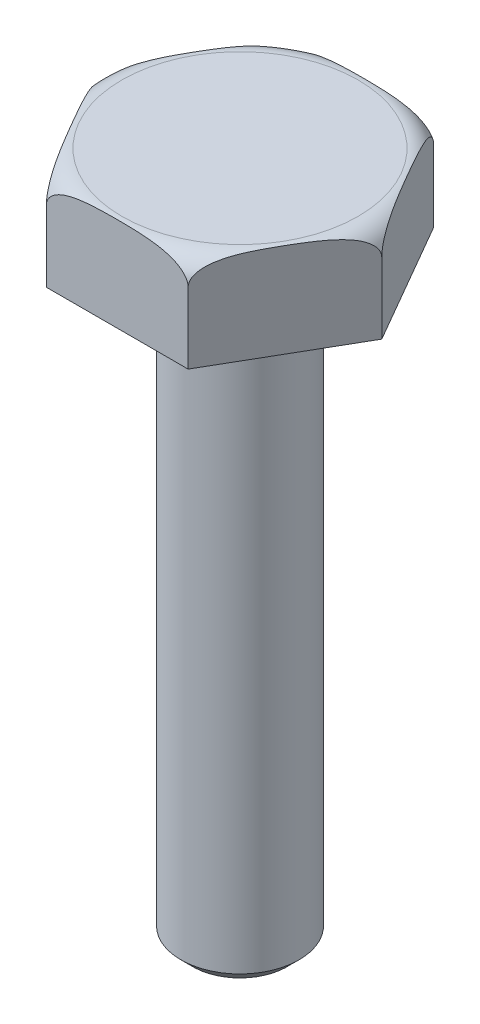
ISO-10303-21;
HEADER;
FILE_DESCRIPTION(('STEP AP214'),'2;1');
FILE_NAME('part.step','',(''),(''),'','','');
FILE_SCHEMA(('AUTOMOTIVE_DESIGN { 1 0 10303 214 1 1 1 1 }'));
ENDSEC;
DATA;
#1=APPLICATION_CONTEXT('core data for automotive mechanical design processes');
#2=APPLICATION_PROTOCOL_DEFINITION('international standard','automotive_design',2000,#1);
#3=PRODUCT_CONTEXT('',#1,'mechanical');
#4=PRODUCT('Part','Part','',(#3));
#5=PRODUCT_RELATED_PRODUCT_CATEGORY('part','',(#4));
#6=PRODUCT_DEFINITION_FORMATION('','',#4);
#7=PRODUCT_DEFINITION_CONTEXT('part definition',#1,'design');
#8=PRODUCT_DEFINITION('design','',#6,#7);
#9=PRODUCT_DEFINITION_SHAPE('','',#8);
#10=(LENGTH_UNIT() NAMED_UNIT(*) SI_UNIT(.MILLI.,.METRE.));
#11=(NAMED_UNIT(*) PLANE_ANGLE_UNIT() SI_UNIT($,.RADIAN.));
#12=(NAMED_UNIT(*) SI_UNIT($,.STERADIAN.) SOLID_ANGLE_UNIT());
#13=UNCERTAINTY_MEASURE_WITH_UNIT(LENGTH_MEASURE(1.E-05),#10,'distance_accuracy_value','');
#14=(GEOMETRIC_REPRESENTATION_CONTEXT(3) GLOBAL_UNCERTAINTY_ASSIGNED_CONTEXT((#13)) GLOBAL_UNIT_ASSIGNED_CONTEXT((#10,
#11,#12)) REPRESENTATION_CONTEXT('',''));
#15=CARTESIAN_POINT('',(0.,0.,0.));
#16=DIRECTION('',(0.,0.,1.));
#17=DIRECTION('',(1.,0.,0.));
#18=AXIS2_PLACEMENT_3D('',#15,#16,#17);
#19=CARTESIAN_POINT('',(12.,16.,20.7846096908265));
#20=DIRECTION('',(-0.866025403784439,0.,-0.5));
#21=DIRECTION('',(-0.5,0.,0.866025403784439));
#22=AXIS2_PLACEMENT_3D('',#19,#20,#21);
#23=PLANE('',#22);
#24=DIRECTION('',(0.,-1.,0.));
#25=VECTOR('',#24,1.);
#26=CARTESIAN_POINT('',(24.,16.,0.));
#27=LINE('',#26,#25);
#28=CARTESIAN_POINT('',(24.,12.,0.));
#29=VERTEX_POINT('',#28);
#30=CARTESIAN_POINT('',(24.,0.,0.));
#31=VERTEX_POINT('',#30);
#32=EDGE_CURVE('E125',#29,#31,#27,.T.);
#33=ORIENTED_EDGE('',*,*,#32,.F.);
#34=CARTESIAN_POINT('',(23.999999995,11.9998,8.6602419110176E-09));
#35=CARTESIAN_POINT('',(24.0000131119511,12.0594851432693,-2.27105655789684E-05));
#36=CARTESIAN_POINT('',(23.9986704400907,12.1191597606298,0.00230286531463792));
#37=CARTESIAN_POINT('',(23.9933511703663,12.2379940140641,0.0115161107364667));
#38=CARTESIAN_POINT('',(23.9893765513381,12.2971540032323,0.0184003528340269));
#39=CARTESIAN_POINT('',(23.9789136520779,12.4140775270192,0.0365226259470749));
#40=CARTESIAN_POINT('',(23.9724461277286,12.4718485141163,0.0477247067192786));
#41=CARTESIAN_POINT('',(23.9571354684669,12.5861092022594,0.074243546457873));
#42=CARTESIAN_POINT('',(23.9482919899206,12.6425987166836,0.0895609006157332));
#43=CARTESIAN_POINT('',(23.9184940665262,12.8093318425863,0.141172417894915));
#44=CARTESIAN_POINT('',(23.8942321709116,12.9172664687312,0.1831952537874));
#45=CARTESIAN_POINT('',(23.8383644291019,13.125328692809,0.279961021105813));
#46=CARTESIAN_POINT('',(23.8067426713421,13.2254387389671,0.334731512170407));
#47=CARTESIAN_POINT('',(23.7157325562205,13.4779672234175,0.492365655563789));
#48=CARTESIAN_POINT('',(23.6514473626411,13.6233297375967,0.603710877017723));
#49=CARTESIAN_POINT('',(23.5124034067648,13.8923832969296,0.844542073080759));
#50=CARTESIAN_POINT('',(23.4376164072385,14.0160138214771,0.974076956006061));
#51=CARTESIAN_POINT('',(23.2924771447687,14.2274791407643,1.22546553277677));
#52=CARTESIAN_POINT('',(23.2230504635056,14.3179049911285,1.34571607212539));
#53=CARTESIAN_POINT('',(23.0805287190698,14.4864745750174,1.59257097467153));
#54=CARTESIAN_POINT('',(23.0074308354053,14.5646086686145,1.7191802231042));
#55=CARTESIAN_POINT('',(22.8585522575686,14.7102052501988,1.97704548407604));
#56=CARTESIAN_POINT('',(22.7827686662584,14.7776557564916,2.10830651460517));
#57=CARTESIAN_POINT('',(22.6293326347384,14.9031707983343,2.3740655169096));
#58=CARTESIAN_POINT('',(22.5516808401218,14.9612385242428,2.50856237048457));
#59=CARTESIAN_POINT('',(22.3608780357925,15.0927633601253,2.83904252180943));
#60=CARTESIAN_POINT('',(22.2469875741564,15.1619170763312,3.03630658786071));
#61=CARTESIAN_POINT('',(22.0173255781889,15.2865240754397,3.4340928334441));
#62=CARTESIAN_POINT('',(21.9015530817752,15.3419701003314,3.63461667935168));
#63=CARTESIAN_POINT('',(21.6685796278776,15.44165755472,4.03813853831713));
#64=CARTESIAN_POINT('',(21.55137625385,15.4858760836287,4.24114073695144));
#65=CARTESIAN_POINT('',(21.3162188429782,15.5649710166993,4.64844532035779));
#66=CARTESIAN_POINT('',(21.198264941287,15.5998490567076,4.85274747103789));
#67=CARTESIAN_POINT('',(20.9609500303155,15.6621884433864,5.26378895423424));
#68=CARTESIAN_POINT('',(20.8415851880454,15.6895904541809,5.47053492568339));
#69=CARTESIAN_POINT('',(20.6025357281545,15.7380546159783,5.88458073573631));
#70=CARTESIAN_POINT('',(20.4828510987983,15.7591165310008,6.09188059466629));
#71=CARTESIAN_POINT('',(20.2434278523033,15.7960807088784,6.50657382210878));
#72=CARTESIAN_POINT('',(20.1236894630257,15.8119889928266,6.71396679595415));
#73=CARTESIAN_POINT('',(19.8840919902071,15.8396735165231,7.12896179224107));
#74=CARTESIAN_POINT('',(19.764232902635,15.8514496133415,7.3365638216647));
#75=CARTESIAN_POINT('',(19.4515164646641,15.8778645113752,7.87820458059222));
#76=CARTESIAN_POINT('',(19.2586046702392,15.8898873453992,8.21233760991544));
#77=CARTESIAN_POINT('',(18.8727092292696,15.9079277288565,8.88072812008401));
#78=CARTESIAN_POINT('',(18.679725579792,15.9139449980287,9.21498560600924));
#79=CARTESIAN_POINT('',(18.2935778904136,15.9213922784,9.88381302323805));
#80=CARTESIAN_POINT('',(18.1004138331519,15.9228184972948,10.2183829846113));
#81=CARTESIAN_POINT('',(17.7140964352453,15.9214375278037,10.8875043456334));
#82=CARTESIAN_POINT('',(17.5209430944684,15.9186304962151,11.2220557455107));
#83=CARTESIAN_POINT('',(17.136139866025,15.908118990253,11.8885544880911));
#84=CARTESIAN_POINT('',(16.9444897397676,15.9004520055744,12.220502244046));
#85=CARTESIAN_POINT('',(16.5612565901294,15.8785292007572,12.8842815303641));
#86=CARTESIAN_POINT('',(16.3696735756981,15.864272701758,13.2161130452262));
#87=CARTESIAN_POINT('',(15.9869306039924,15.8264083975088,13.8790433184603));
#88=CARTESIAN_POINT('',(15.7957704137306,15.8028104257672,14.2101424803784));
#89=CARTESIAN_POINT('',(15.4139859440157,15.7423868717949,14.8714125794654));
#90=CARTESIAN_POINT('',(15.2233615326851,15.7055648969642,15.2015837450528));
#91=CARTESIAN_POINT('',(14.944220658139,15.637921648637,15.6850699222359));
#92=CARTESIAN_POINT('',(14.8552671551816,15.6143074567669,15.8391419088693));
#93=CARTESIAN_POINT('',(14.6776944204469,15.5623388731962,16.1467069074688));
#94=CARTESIAN_POINT('',(14.5890752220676,15.5339840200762,16.3001998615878));
#95=CARTESIAN_POINT('',(14.4118131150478,15.4716089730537,16.6072268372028));
#96=CARTESIAN_POINT('',(14.3231729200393,15.4375575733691,16.7607561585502));
#97=CARTESIAN_POINT('',(14.1465729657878,15.3630171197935,17.0666362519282));
#98=CARTESIAN_POINT('',(14.0586131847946,15.3225282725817,17.2189870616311));
#99=CARTESIAN_POINT('',(13.8496741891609,15.2169369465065,17.5808800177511));
#100=CARTESIAN_POINT('',(13.7291196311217,15.1483786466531,17.7896866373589));
#101=CARTESIAN_POINT('',(13.4907199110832,14.9935349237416,18.2026070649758));
#102=CARTESIAN_POINT('',(13.3728775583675,14.9072319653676,18.4067160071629));
#103=CARTESIAN_POINT('',(13.1426057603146,14.7135325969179,18.8055584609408));
#104=CARTESIAN_POINT('',(13.0301394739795,14.6063174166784,19.0003557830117));
#105=CARTESIAN_POINT('',(12.8670537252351,14.4257593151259,19.2828285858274));
#106=CARTESIAN_POINT('',(12.8136765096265,14.3623551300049,19.3752806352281));
#107=CARTESIAN_POINT('',(12.7092851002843,14.2282286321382,19.5560918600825));
#108=CARTESIAN_POINT('',(12.6582700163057,14.1575091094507,19.6444525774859));
#109=CARTESIAN_POINT('',(12.5468074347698,13.9891912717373,19.8375114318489));
#110=CARTESIAN_POINT('',(12.4872095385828,13.8893034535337,19.9407380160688));
#111=CARTESIAN_POINT('',(12.374502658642,13.6753894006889,20.135952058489));
#112=CARTESIAN_POINT('',(12.3214007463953,13.5613480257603,20.2279272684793));
#113=CARTESIAN_POINT('',(12.2236974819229,13.3169039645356,20.3971542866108));
#114=CARTESIAN_POINT('',(12.1792101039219,13.1863153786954,20.4742086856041));
#115=CARTESIAN_POINT('',(12.1031493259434,12.9111440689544,20.605949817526));
#116=CARTESIAN_POINT('',(12.0715223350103,12.7666225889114,20.6607293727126));
#117=CARTESIAN_POINT('',(12.0324033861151,12.517612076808,20.7284853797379));
#118=CARTESIAN_POINT('',(12.0203736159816,12.4159683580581,20.7493215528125));
#119=CARTESIAN_POINT('',(12.008211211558,12.2613442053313,20.7703874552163));
#120=CARTESIAN_POINT('',(12.0051371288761,12.2092520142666,20.7757119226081));
#121=CARTESIAN_POINT('',(12.0010272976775,12.104712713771,20.7828303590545));
#122=CARTESIAN_POINT('',(11.9999929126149,12.0522653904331,20.7846219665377));
#123=CARTESIAN_POINT('',(12.000000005,11.9998,20.7846096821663));
#124=B_SPLINE_CURVE_WITH_KNOTS('',3,(#34,#35,#36,#37,#38,#39,#40,#41,#42,#43,#44,#45,#46,#47,
#48,#49,#50,#51,#52,#53,#54,#55,#56,#57,#58,#59,#60,#61,#62,#63,#64,#65,#66,#67,#68,#69,#70,#71,
#72,#73,#74,#75,#76,#77,#78,#79,#80,#81,#82,#83,#84,#85,#86,#87,#88,#89,#90,#91,#92,#93,#94,#95,
#96,#97,#98,#99,#100,#101,#102,#103,#104,#105,#106,#107,#108,#109,#110,#111,#112,#113,#114,#115,
#116,#117,#118,#119,#120,#121,#122,#123),.UNSPECIFIED.,.F.,.F.,(4,2,2,2,2,2,2,2,2,2,2,2,2,2,2,2,
2,2,2,2,2,2,2,2,2,2,2,2,2,2,2,2,2,2,2,2,2,2,2,2,2,2,2,2,4),(0.,0.178977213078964,
0.357820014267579,0.535204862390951,0.712615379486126,1.06615012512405,1.42045640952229,
1.99929604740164,2.579722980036,3.07611523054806,3.57289486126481,4.07022774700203,
4.56739117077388,5.28096087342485,5.99490759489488,6.71029905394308,7.42556514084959,
8.14635311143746,8.86716790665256,9.58713749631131,10.3071319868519,11.4650899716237,
12.6231019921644,13.782070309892,14.9409957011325,16.0910881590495,17.2412991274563,
18.3903025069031,19.538992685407,20.0773435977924,20.615746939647,21.1572025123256,
21.6986407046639,22.4500705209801,23.2022465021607,23.9481724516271,24.3204136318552,
24.6925133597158,25.1580822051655,25.624153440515,26.0960230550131,26.5659056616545,
26.8780698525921,27.0352854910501,27.1926061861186),.UNSPECIFIED.);
#125=CARTESIAN_POINT('',(12.,12.,20.7846096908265));
#126=VERTEX_POINT('',#125);
#127=EDGE_CURVE('E104',#29,#126,#124,.T.);
#128=ORIENTED_EDGE('',*,*,#127,.T.);
#129=DIRECTION('',(0.,-1.,0.));
#130=VECTOR('',#129,1.);
#131=CARTESIAN_POINT('',(12.,16.,20.7846096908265));
#132=LINE('',#131,#130);
#133=CARTESIAN_POINT('',(12.,0.,20.7846096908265));
#134=VERTEX_POINT('',#133);
#135=EDGE_CURVE('E69',#126,#134,#132,.T.);
#136=ORIENTED_EDGE('',*,*,#135,.T.);
#137=DIRECTION('',(0.5,0.,-0.866025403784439));
#138=VECTOR('',#137,1.);
#139=CARTESIAN_POINT('',(12.,0.,20.7846096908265));
#140=LINE('',#139,#138);
#141=EDGE_CURVE('E150',#134,#31,#140,.T.);
#142=ORIENTED_EDGE('',*,*,#141,.T.);
#143=EDGE_LOOP('',(#33,#128,#136,#142));
#144=FACE_BOUND('',#143,.T.);
#145=ADVANCED_FACE('F45',(#144),#23,.F.);
#146=CARTESIAN_POINT('',(24.,16.,0.));
#147=DIRECTION('',(-0.866025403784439,0.,0.5));
#148=DIRECTION('',(0.5,0.,0.866025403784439));
#149=AXIS2_PLACEMENT_3D('',#146,#147,#148);
#150=PLANE('',#149);
#151=DIRECTION('',(0.,-1.,0.));
#152=VECTOR('',#151,1.);
#153=CARTESIAN_POINT('',(12.,16.,-20.7846096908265));
#154=LINE('',#153,#152);
#155=CARTESIAN_POINT('',(12.,12.,-20.7846096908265));
#156=VERTEX_POINT('',#155);
#157=CARTESIAN_POINT('',(12.,0.,-20.7846096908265));
#158=VERTEX_POINT('',#157);
#159=EDGE_CURVE('E114',#156,#158,#154,.T.);
#160=ORIENTED_EDGE('',*,*,#159,.F.);
#161=CARTESIAN_POINT('',(12.000000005,11.9998,-20.7846096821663));
#162=CARTESIAN_POINT('',(11.9999868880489,12.0594851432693,-20.7846324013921));
#163=CARTESIAN_POINT('',(12.0013295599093,12.1191597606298,-20.7823068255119));
#164=CARTESIAN_POINT('',(12.0066488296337,12.2379940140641,-20.77309358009));
#165=CARTESIAN_POINT('',(12.0106234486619,12.2971540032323,-20.7662093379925));
#166=CARTESIAN_POINT('',(12.0210863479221,12.4140775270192,-20.7480870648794));
#167=CARTESIAN_POINT('',(12.0275538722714,12.4718485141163,-20.7368849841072));
#168=CARTESIAN_POINT('',(12.0428645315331,12.5861092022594,-20.7103661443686));
#169=CARTESIAN_POINT('',(12.0517080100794,12.6425987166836,-20.6950487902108));
#170=CARTESIAN_POINT('',(12.0815059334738,12.8093318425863,-20.6434372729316));
#171=CARTESIAN_POINT('',(12.1057678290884,12.9172664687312,-20.6014144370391));
#172=CARTESIAN_POINT('',(12.161635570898,13.125328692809,-20.5046486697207));
#173=CARTESIAN_POINT('',(12.1932573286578,13.2254387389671,-20.4498781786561));
#174=CARTESIAN_POINT('',(12.2842674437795,13.4779672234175,-20.2922440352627));
#175=CARTESIAN_POINT('',(12.3485526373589,13.6233297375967,-20.1808988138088));
#176=CARTESIAN_POINT('',(12.4875965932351,13.8923832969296,-19.9400676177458));
#177=CARTESIAN_POINT('',(12.5623835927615,14.0160138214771,-19.8105327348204));
#178=CARTESIAN_POINT('',(12.7075228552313,14.2274791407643,-19.5591441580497));
#179=CARTESIAN_POINT('',(12.7769495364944,14.3179049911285,-19.4388936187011));
#180=CARTESIAN_POINT('',(12.9194712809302,14.4864745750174,-19.192038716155));
#181=CARTESIAN_POINT('',(12.9925691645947,14.5646086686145,-19.0654294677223));
#182=CARTESIAN_POINT('',(13.1414477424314,14.7102052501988,-18.8075642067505));
#183=CARTESIAN_POINT('',(13.2172313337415,14.7776557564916,-18.6763031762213));
#184=CARTESIAN_POINT('',(13.3706673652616,14.9031707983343,-18.4105441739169));
#185=CARTESIAN_POINT('',(13.4483191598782,14.9612385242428,-18.2760473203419));
#186=CARTESIAN_POINT('',(13.6391219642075,15.0927633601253,-17.9455671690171));
#187=CARTESIAN_POINT('',(13.7530124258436,15.1619170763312,-17.7483031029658));
#188=CARTESIAN_POINT('',(13.9826744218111,15.2865240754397,-17.3505168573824));
#189=CARTESIAN_POINT('',(14.0984469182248,15.3419701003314,-17.1499930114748));
#190=CARTESIAN_POINT('',(14.3314203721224,15.44165755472,-16.7464711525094));
#191=CARTESIAN_POINT('',(14.44862374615,15.4858760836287,-16.5434689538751));
#192=CARTESIAN_POINT('',(14.6837811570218,15.5649710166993,-16.1361643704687));
#193=CARTESIAN_POINT('',(14.801735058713,15.5998490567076,-15.9318622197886));
#194=CARTESIAN_POINT('',(15.0390499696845,15.6621884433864,-15.5208207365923));
#195=CARTESIAN_POINT('',(15.1584148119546,15.6895904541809,-15.3140747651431));
#196=CARTESIAN_POINT('',(15.3974642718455,15.7380546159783,-14.9000289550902));
#197=CARTESIAN_POINT('',(15.5171489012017,15.7591165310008,-14.6927290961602));
#198=CARTESIAN_POINT('',(15.7565721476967,15.7960807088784,-14.2780358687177));
#199=CARTESIAN_POINT('',(15.8763105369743,15.8119889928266,-14.0706428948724));
#200=CARTESIAN_POINT('',(16.115908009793,15.8396735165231,-13.6556478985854));
#201=CARTESIAN_POINT('',(16.235767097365,15.8514496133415,-13.4480458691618));
#202=CARTESIAN_POINT('',(16.5484835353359,15.8778645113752,-12.9064051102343));
#203=CARTESIAN_POINT('',(16.7413953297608,15.8898873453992,-12.5722720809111));
#204=CARTESIAN_POINT('',(17.1272907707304,15.9079277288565,-11.9038815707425));
#205=CARTESIAN_POINT('',(17.320274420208,15.9139449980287,-11.5696240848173));
#206=CARTESIAN_POINT('',(17.7064221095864,15.9213922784,-10.9007966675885));
#207=CARTESIAN_POINT('',(17.899586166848,15.9228184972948,-10.5662267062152));
#208=CARTESIAN_POINT('',(18.2859035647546,15.9214375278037,-9.89710534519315));
#209=CARTESIAN_POINT('',(18.4790569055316,15.9186304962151,-9.56255394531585));
#210=CARTESIAN_POINT('',(18.8638601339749,15.908118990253,-8.89605520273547));
#211=CARTESIAN_POINT('',(19.0555102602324,15.9004520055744,-8.56410744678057));
#212=CARTESIAN_POINT('',(19.4387434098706,15.8785292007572,-7.90032816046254));
#213=CARTESIAN_POINT('',(19.6303264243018,15.864272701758,-7.56849664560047));
#214=CARTESIAN_POINT('',(20.0130693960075,15.8264083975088,-6.90556637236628));
#215=CARTESIAN_POINT('',(20.2042295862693,15.8028104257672,-6.57446721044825));
#216=CARTESIAN_POINT('',(20.5860140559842,15.7423868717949,-5.91319711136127));
#217=CARTESIAN_POINT('',(20.7766384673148,15.7055648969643,-5.58302594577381));
#218=CARTESIAN_POINT('',(21.0557793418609,15.637921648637,-5.09953976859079));
#219=CARTESIAN_POINT('',(21.1447328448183,15.6143074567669,-4.94546778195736));
#220=CARTESIAN_POINT('',(21.322305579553,15.5623388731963,-4.63790278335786));
#221=CARTESIAN_POINT('',(21.4109247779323,15.5339840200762,-4.48440982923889));
#222=CARTESIAN_POINT('',(21.5881868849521,15.4716089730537,-4.17738285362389));
#223=CARTESIAN_POINT('',(21.6768270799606,15.4375575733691,-4.0238535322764));
#224=CARTESIAN_POINT('',(21.8534270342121,15.3630171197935,-3.71797343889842));
#225=CARTESIAN_POINT('',(21.9413868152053,15.3225282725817,-3.56562262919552));
#226=CARTESIAN_POINT('',(22.150325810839,15.2169369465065,-3.20372967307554));
#227=CARTESIAN_POINT('',(22.2708803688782,15.1483786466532,-2.99492305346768));
#228=CARTESIAN_POINT('',(22.5092800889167,14.9935349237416,-2.58200262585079));
#229=CARTESIAN_POINT('',(22.6271224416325,14.9072319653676,-2.37789368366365));
#230=CARTESIAN_POINT('',(22.8573942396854,14.7135325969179,-1.9790512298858));
#231=CARTESIAN_POINT('',(22.9698605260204,14.6063174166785,-1.7842539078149));
#232=CARTESIAN_POINT('',(23.1329462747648,14.4257593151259,-1.50178110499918));
#233=CARTESIAN_POINT('',(23.1863234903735,14.3623551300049,-1.40932905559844));
#234=CARTESIAN_POINT('',(23.2907148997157,14.2282286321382,-1.22851783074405));
#235=CARTESIAN_POINT('',(23.3417299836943,14.1575091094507,-1.1401571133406));
#236=CARTESIAN_POINT('',(23.4531925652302,13.9891912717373,-0.947098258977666));
#237=CARTESIAN_POINT('',(23.5127904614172,13.8893034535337,-0.843871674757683));
#238=CARTESIAN_POINT('',(23.625497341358,13.6753894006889,-0.648657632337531));
#239=CARTESIAN_POINT('',(23.6785992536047,13.5613480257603,-0.556682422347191));
#240=CARTESIAN_POINT('',(23.7763025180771,13.3169039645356,-0.387455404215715));
#241=CARTESIAN_POINT('',(23.8207898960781,13.1863153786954,-0.310401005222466));
#242=CARTESIAN_POINT('',(23.8968506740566,12.9111440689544,-0.178659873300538));
#243=CARTESIAN_POINT('',(23.9284776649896,12.7666225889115,-0.123880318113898));
#244=CARTESIAN_POINT('',(23.9675966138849,12.517612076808,-0.056124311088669));
#245=CARTESIAN_POINT('',(23.9796263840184,12.4159683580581,-0.0352881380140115));
#246=CARTESIAN_POINT('',(23.991788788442,12.2613442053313,-0.0142222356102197));
#247=CARTESIAN_POINT('',(23.9948628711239,12.2092520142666,-0.00889776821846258));
#248=CARTESIAN_POINT('',(23.9989727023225,12.104712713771,-0.00177933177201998));
#249=CARTESIAN_POINT('',(24.0000070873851,12.0522653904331,1.22757111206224E-05));
#250=CARTESIAN_POINT('',(23.999999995,11.9998,-8.66026680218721E-09));
#251=B_SPLINE_CURVE_WITH_KNOTS('',3,(#161,#162,#163,#164,#165,#166,#167,#168,#169,#170,#171,
#172,#173,#174,#175,#176,#177,#178,#179,#180,#181,#182,#183,#184,#185,#186,#187,#188,#189,#190,
#191,#192,#193,#194,#195,#196,#197,#198,#199,#200,#201,#202,#203,#204,#205,#206,#207,#208,#209,
#210,#211,#212,#213,#214,#215,#216,#217,#218,#219,#220,#221,#222,#223,#224,#225,#226,#227,#228,
#229,#230,#231,#232,#233,#234,#235,#236,#237,#238,#239,#240,#241,#242,#243,#244,#245,#246,#247,
#248,#249,#250),.UNSPECIFIED.,.F.,.F.,(4,2,2,2,2,2,2,2,2,2,2,2,2,2,2,2,2,2,2,2,2,2,2,2,2,2,2,2,
2,2,2,2,2,2,2,2,2,2,2,2,2,2,2,2,4),(0.,0.178977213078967,0.357820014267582,0.535204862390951,
0.712615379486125,1.06615012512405,1.42045640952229,1.99929604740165,2.579722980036,
3.07611523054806,3.57289486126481,4.07022774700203,4.56739117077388,5.28096087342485,
5.99490759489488,6.71029905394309,7.4255651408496,8.14635311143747,8.86716790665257,
9.58713749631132,10.3071319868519,11.4650899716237,12.6231019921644,13.7820703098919,
14.9409957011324,16.0910881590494,17.2412991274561,18.390302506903,19.5389926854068,
20.0773435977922,20.6157469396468,21.1572025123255,21.6986407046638,22.45007052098,
23.2022465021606,23.9481724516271,24.3204136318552,24.6925133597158,25.1580822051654,
25.624153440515,26.096023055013,26.5659056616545,26.8780698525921,27.0352854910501,
27.1926061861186),.UNSPECIFIED.);
#252=EDGE_CURVE('E99',#156,#29,#251,.T.);
#253=ORIENTED_EDGE('',*,*,#252,.T.);
#254=ORIENTED_EDGE('',*,*,#32,.T.);
#255=DIRECTION('',(-0.5,0.,-0.866025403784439));
#256=VECTOR('',#255,1.);
#257=CARTESIAN_POINT('',(24.,0.,0.));
#258=LINE('',#257,#256);
#259=EDGE_CURVE('E122',#31,#158,#258,.T.);
#260=ORIENTED_EDGE('',*,*,#259,.T.);
#261=EDGE_LOOP('',(#160,#253,#254,#260));
#262=FACE_BOUND('',#261,.T.);
#263=ADVANCED_FACE('F120',(#262),#150,.F.);
#264=CARTESIAN_POINT('',(12.,16.,-20.7846096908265));
#265=DIRECTION('',(0.,0.,1.));
#266=DIRECTION('',(1.,0.,0.));
#267=AXIS2_PLACEMENT_3D('',#264,#265,#266);
#268=PLANE('',#267);
#269=DIRECTION('',(0.,-1.,0.));
#270=VECTOR('',#269,1.);
#271=CARTESIAN_POINT('',(-12.,16.,-20.7846096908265));
#272=LINE('',#271,#270);
#273=CARTESIAN_POINT('',(-12.,12.,-20.7846096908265));
#274=VERTEX_POINT('',#273);
#275=CARTESIAN_POINT('',(-12.,0.,-20.7846096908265));
#276=VERTEX_POINT('',#275);
#277=EDGE_CURVE('E116',#274,#276,#272,.T.);
#278=ORIENTED_EDGE('',*,*,#277,.F.);
#279=CARTESIAN_POINT('',(0.,15.9222936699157,-20.7846096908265));
#280=CARTESIAN_POINT('',(0.335874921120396,15.9222892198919,-20.7846096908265));
#281=CARTESIAN_POINT('',(0.671749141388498,15.9206892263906,-20.7846096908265));
#282=CARTESIAN_POINT('',(1.34347258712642,15.9139742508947,-20.7846096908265));
#283=CARTESIAN_POINT('',(1.67932181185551,15.9088591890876,-20.7846096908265));
#284=CARTESIAN_POINT('',(2.35134241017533,15.8941972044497,-20.7846096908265));
#285=CARTESIAN_POINT('',(2.68751367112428,15.884644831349,-20.7846096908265));
#286=CARTESIAN_POINT('',(3.35962863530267,15.8595731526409,-20.7846096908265));
#287=CARTESIAN_POINT('',(3.69557234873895,15.8440541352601,-20.7846096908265));
#288=CARTESIAN_POINT('',(4.36522908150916,15.8049822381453,-20.7846096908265));
#289=CARTESIAN_POINT('',(4.69894450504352,15.781472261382,-20.7846096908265));
#290=CARTESIAN_POINT('',(5.36554653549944,15.7235750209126,-20.7846096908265));
#291=CARTESIAN_POINT('',(5.69843293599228,15.6891852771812,-20.7846096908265));
#292=CARTESIAN_POINT('',(6.36165802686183,15.6060055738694,-20.7846096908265));
#293=CARTESIAN_POINT('',(6.69200084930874,15.5572493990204,-20.7846096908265));
#294=CARTESIAN_POINT('',(7.34926288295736,15.4407416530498,-20.7846096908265));
#295=CARTESIAN_POINT('',(7.67618417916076,15.3730024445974,-20.7846096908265));
#296=CARTESIAN_POINT('',(8.15909233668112,15.253343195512,-20.7846096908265));
#297=CARTESIAN_POINT('',(8.31743507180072,15.2109049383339,-20.7846096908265));
#298=CARTESIAN_POINT('',(8.63215501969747,15.1190768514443,-20.7846096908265));
#299=CARTESIAN_POINT('',(8.78853174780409,15.0696853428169,-20.7846096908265));
#300=CARTESIAN_POINT('',(9.09867674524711,14.9629149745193,-20.7846096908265));
#301=CARTESIAN_POINT('',(9.25244310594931,14.9055305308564,-20.7846096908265));
#302=CARTESIAN_POINT('',(9.55625235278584,14.7816295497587,-20.7846096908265));
#303=CARTESIAN_POINT('',(9.70629616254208,14.7151153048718,-20.7846096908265));
#304=CARTESIAN_POINT('',(9.96931616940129,14.5871463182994,-20.7846096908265));
#305=CARTESIAN_POINT('',(10.0832767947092,14.5277205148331,-20.7846096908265));
#306=CARTESIAN_POINT('',(10.307150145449,14.4016993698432,-20.7846096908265));
#307=CARTESIAN_POINT('',(10.4170640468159,14.3351061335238,-20.7846096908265));
#308=CARTESIAN_POINT('',(10.6315005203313,14.1940580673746,-20.7846096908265));
#309=CARTESIAN_POINT('',(10.7360320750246,14.1196170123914,-20.7846096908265));
#310=CARTESIAN_POINT('',(10.9382442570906,13.9620187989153,-20.7846096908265));
#311=CARTESIAN_POINT('',(11.0359293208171,13.8788673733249,-20.7846096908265));
#312=CARTESIAN_POINT('',(11.2397651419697,13.6867134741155,-20.7846096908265));
#313=CARTESIAN_POINT('',(11.3441251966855,13.5757768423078,-20.7846096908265));
#314=CARTESIAN_POINT('',(11.5355920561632,13.3398368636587,-20.7846096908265));
#315=CARTESIAN_POINT('',(11.6227206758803,13.2148516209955,-20.7846096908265));
#316=CARTESIAN_POINT('',(11.7606330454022,12.9743713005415,-20.7846096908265));
#317=CARTESIAN_POINT('',(11.8151036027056,12.861012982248,-20.7846096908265));
#318=CARTESIAN_POINT('',(11.9045333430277,12.6267947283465,-20.7846096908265));
#319=CARTESIAN_POINT('',(11.9395080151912,12.5059408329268,-20.7846096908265));
#320=CARTESIAN_POINT('',(11.9870956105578,12.2590126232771,-20.7846096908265));
#321=CARTESIAN_POINT('',(11.9995640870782,12.1329098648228,-20.7846096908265));
#322=CARTESIAN_POINT('',(12.0004130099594,11.8806262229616,-20.7846096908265));
#323=CARTESIAN_POINT('',(11.9887964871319,11.7544453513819,-20.7846096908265));
#324=CARTESIAN_POINT('',(11.9450290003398,11.5189832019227,-20.7846096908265));
#325=CARTESIAN_POINT('',(11.9150681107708,11.4092813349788,-20.7846096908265));
#326=CARTESIAN_POINT('',(11.8388654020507,11.1957551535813,-20.7846096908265));
#327=CARTESIAN_POINT('',(11.7926191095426,11.0919324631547,-20.7846096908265));
#328=CARTESIAN_POINT('',(11.6634645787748,10.8480884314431,-20.7846096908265));
#329=CARTESIAN_POINT('',(11.5733545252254,10.7118923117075,-20.7846096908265));
#330=CARTESIAN_POINT('',(11.3725702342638,10.4555127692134,-20.7846096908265));
#331=CARTESIAN_POINT('',(11.2618412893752,10.335373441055,-20.7846096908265));
#332=CARTESIAN_POINT('',(11.0507671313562,10.1342468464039,-20.7846096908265));
#333=CARTESIAN_POINT('',(10.9531438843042,10.050341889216,-20.7846096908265));
#334=CARTESIAN_POINT('',(10.7509173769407,9.89133764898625,-20.7846096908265));
#335=CARTESIAN_POINT('',(10.6463098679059,9.81624380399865,-20.7846096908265));
#336=CARTESIAN_POINT('',(10.4317748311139,9.67408072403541,-20.7846096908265));
#337=CARTESIAN_POINT('',(10.3218456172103,9.60701405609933,-20.7846096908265));
#338=CARTESIAN_POINT('',(10.0978709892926,9.48010778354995,-20.7846096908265));
#339=CARTESIAN_POINT('',(9.98382397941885,9.42027102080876,-20.7846096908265));
#340=CARTESIAN_POINT('',(9.64370551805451,9.25379611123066,-20.7846096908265));
#341=CARTESIAN_POINT('',(9.41323427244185,9.15612061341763,-20.7846096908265));
#342=CARTESIAN_POINT('',(8.94485493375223,8.98048809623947,-20.7846096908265));
#343=CARTESIAN_POINT('',(8.70693926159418,8.90255195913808,-20.7846096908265));
#344=CARTESIAN_POINT('',(8.22523209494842,8.7623912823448,-20.7846096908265));
#345=CARTESIAN_POINT('',(7.98141645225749,8.70025068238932,-20.7846096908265));
#346=CARTESIAN_POINT('',(7.61360859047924,8.61698648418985,-20.7846096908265));
#347=CARTESIAN_POINT('',(7.49070137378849,8.5908968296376,-20.7846096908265));
#348=CARTESIAN_POINT('',(7.24429541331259,8.54170513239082,-20.7846096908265));
#349=CARTESIAN_POINT('',(7.12079670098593,8.51860293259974,-20.7846096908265));
#350=CARTESIAN_POINT('',(6.71790040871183,8.4477496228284,-20.7846096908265));
#351=CARTESIAN_POINT('',(6.43753275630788,8.40548733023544,-20.7846096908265));
#352=CARTESIAN_POINT('',(5.87536222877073,8.33174881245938,-20.7846096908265));
#353=CARTESIAN_POINT('',(5.59355900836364,8.30027531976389,-20.7846096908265));
#354=CARTESIAN_POINT('',(5.02887703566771,8.24578814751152,-20.7846096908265));
#355=CARTESIAN_POINT('',(4.74599750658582,8.22278268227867,-20.7846096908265));
#356=CARTESIAN_POINT('',(4.17981620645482,8.18339093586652,-20.7846096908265));
#357=CARTESIAN_POINT('',(3.8965144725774,8.16700410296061,-20.7846096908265));
#358=CARTESIAN_POINT('',(3.32838813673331,8.1392743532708,-20.7846096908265));
#359=CARTESIAN_POINT('',(3.04356244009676,8.12795457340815,-20.7846096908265));
#360=CARTESIAN_POINT('',(2.47378100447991,8.10927961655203,-20.7846096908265));
#361=CARTESIAN_POINT('',(2.18882526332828,8.10192450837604,-20.7846096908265));
#362=CARTESIAN_POINT('',(1.61901854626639,8.09031986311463,-20.7846096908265));
#363=CARTESIAN_POINT('',(1.33416760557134,8.08606852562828,-20.7846096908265));
#364=CARTESIAN_POINT('',(0.76444251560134,8.08012024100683,-20.7846096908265));
#365=CARTESIAN_POINT('',(0.479568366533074,8.07842327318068,-20.7846096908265));
#366=CARTESIAN_POINT('',(-0.0906369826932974,8.07735356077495,-20.7846096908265));
#367=CARTESIAN_POINT('',(-0.375968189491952,8.07798451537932,-20.7846096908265));
#368=CARTESIAN_POINT('',(-0.946617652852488,8.08166523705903,-20.7846096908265));
#369=CARTESIAN_POINT('',(-1.2319359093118,8.0847150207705,-20.7846096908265));
#370=CARTESIAN_POINT('',(-1.80267481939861,8.0936390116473,-20.7846096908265));
#371=CARTESIAN_POINT('',(-2.08809545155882,8.09951465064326,-20.7846096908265));
#372=CARTESIAN_POINT('',(-2.65884135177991,8.1148129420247,-20.7846096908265));
#373=CARTESIAN_POINT('',(-2.94416662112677,8.12423554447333,-20.7846096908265));
#374=CARTESIAN_POINT('',(-3.51343881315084,8.14762364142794,-20.7846096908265));
#375=CARTESIAN_POINT('',(-3.79738649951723,8.16156992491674,-20.7846096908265));
#376=CARTESIAN_POINT('',(-4.36496043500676,8.19537942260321,-20.7846096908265));
#377=CARTESIAN_POINT('',(-4.64858666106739,8.21524303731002,-20.7846096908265));
#378=CARTESIAN_POINT('',(-5.21499037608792,8.26258884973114,-20.7846096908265));
#379=CARTESIAN_POINT('',(-5.49776835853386,8.29006501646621,-20.7846096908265));
#380=CARTESIAN_POINT('',(-6.06219129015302,8.35475669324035,-20.7846096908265));
#381=CARTESIAN_POINT('',(-6.34383646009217,8.39197020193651,-20.7846096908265));
#382=CARTESIAN_POINT('',(-6.76467178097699,8.45703703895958,-20.7846096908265));
#383=CARTESIAN_POINT('',(-6.90458281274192,8.4802480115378,-20.7846096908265));
#384=CARTESIAN_POINT('',(-7.18379392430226,8.53014686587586,-20.7846096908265));
#385=CARTESIAN_POINT('',(-7.32309397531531,8.55683490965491,-20.7846096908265));
#386=CARTESIAN_POINT('',(-7.60103111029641,8.61414021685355,-20.7846096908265));
#387=CARTESIAN_POINT('',(-7.73966743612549,8.64476119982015,-20.7846096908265));
#388=CARTESIAN_POINT('',(-8.01588491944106,8.71039594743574,-20.7846096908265));
#389=CARTESIAN_POINT('',(-8.15346607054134,8.74540973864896,-20.7846096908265));
#390=CARTESIAN_POINT('',(-8.56276332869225,8.85743399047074,-20.7846096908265));
#391=CARTESIAN_POINT('',(-8.83259682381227,8.94173714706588,-20.7846096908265));
#392=CARTESIAN_POINT('',(-9.23046248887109,9.08658539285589,-20.7846096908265));
#393=CARTESIAN_POINT('',(-9.36187908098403,9.13790637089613,-20.7846096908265));
#394=CARTESIAN_POINT('',(-9.62177342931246,9.24748451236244,-20.7846096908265));
#395=CARTESIAN_POINT('',(-9.75025201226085,9.30573969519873,-20.7846096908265));
#396=CARTESIAN_POINT('',(-10.0048283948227,9.43077525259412,-20.7846096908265));
#397=CARTESIAN_POINT('',(-10.1308827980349,9.49764464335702,-20.7846096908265));
#398=CARTESIAN_POINT('',(-10.3777530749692,9.64036951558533,-20.7846096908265));
#399=CARTESIAN_POINT('',(-10.4985718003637,9.71622001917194,-20.7846096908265));
#400=CARTESIAN_POINT('',(-10.732941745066,9.87779683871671,-20.7846096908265));
#401=CARTESIAN_POINT('',(-10.8465140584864,9.96349224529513,-20.7846096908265));
#402=CARTESIAN_POINT('',(-11.0642919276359,10.1459510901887,-20.7846096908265));
#403=CARTESIAN_POINT('',(-11.1685080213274,10.2427017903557,-20.7846096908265));
#404=CARTESIAN_POINT('',(-11.3619812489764,10.4456476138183,-20.7846096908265));
#405=CARTESIAN_POINT('',(-11.4515509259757,10.5515406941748,-20.7846096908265));
#406=CARTESIAN_POINT('',(-11.6148664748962,10.7750477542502,-20.7846096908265));
#407=CARTESIAN_POINT('',(-11.6886163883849,10.8926587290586,-20.7846096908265));
#408=CARTESIAN_POINT('',(-11.8162428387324,11.1401142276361,-20.7846096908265));
#409=CARTESIAN_POINT('',(-11.8698865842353,11.270081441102,-20.7846096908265));
#410=CARTESIAN_POINT('',(-11.9510153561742,11.5379480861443,-20.7846096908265));
#411=CARTESIAN_POINT('',(-11.9785398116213,11.6758352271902,-20.7846096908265));
#412=CARTESIAN_POINT('',(-12.0028466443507,11.938116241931,-20.7846096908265));
#413=CARTESIAN_POINT('',(-12.0028292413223,12.0622164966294,-20.7846096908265));
#414=CARTESIAN_POINT('',(-11.9799973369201,12.3082923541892,-20.7846096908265));
#415=CARTESIAN_POINT('',(-11.9571801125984,12.4302677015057,-20.7846096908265));
#416=CARTESIAN_POINT('',(-11.8934473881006,12.6590972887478,-20.7846096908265));
#417=CARTESIAN_POINT('',(-11.854070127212,12.7663910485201,-20.7846096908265));
#418=CARTESIAN_POINT('',(-11.7603260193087,12.9741392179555,-20.7846096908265));
#419=CARTESIAN_POINT('',(-11.7059546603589,13.0745915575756,-20.7846096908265));
#420=CARTESIAN_POINT('',(-11.5513403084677,13.3213920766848,-20.7846096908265));
#421=CARTESIAN_POINT('',(-11.442385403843,13.4622746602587,-20.7846096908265));
#422=CARTESIAN_POINT('',(-11.203703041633,13.7252165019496,-20.7846096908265));
#423=CARTESIAN_POINT('',(-11.0739207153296,13.8472243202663,-20.7846096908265));
#424=CARTESIAN_POINT('',(-10.8245289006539,14.0537424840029,-20.7846096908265));
#425=CARTESIAN_POINT('',(-10.7072014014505,14.1410648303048,-20.7846096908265));
#426=CARTESIAN_POINT('',(-10.465372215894,14.3052376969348,-20.7846096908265));
#427=CARTESIAN_POINT('',(-10.3408655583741,14.382080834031,-20.7846096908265));
#428=CARTESIAN_POINT('',(-10.0863643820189,14.5265365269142,-20.7846096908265));
#429=CARTESIAN_POINT('',(-9.95636042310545,14.594132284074,-20.7846096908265));
#430=CARTESIAN_POINT('',(-9.69243021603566,14.7210073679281,-20.7846096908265));
#431=CARTESIAN_POINT('',(-9.55850495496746,14.7802887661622,-20.7846096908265));
#432=CARTESIAN_POINT('',(-9.24942605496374,14.9072401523,-20.7846096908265));
#433=CARTESIAN_POINT('',(-9.07330776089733,14.9725530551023,-20.7846096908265));
#434=CARTESIAN_POINT('',(-8.71756833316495,15.0929265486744,-20.7846096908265));
#435=CARTESIAN_POINT('',(-8.5379457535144,15.147982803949,-20.7846096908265));
#436=CARTESIAN_POINT('',(-8.17596215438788,15.2493814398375,-20.7846096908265));
#437=CARTESIAN_POINT('',(-7.99359712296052,15.2957093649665,-20.7846096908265));
#438=CARTESIAN_POINT('',(-7.62715480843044,15.380797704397,-20.7846096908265));
#439=CARTESIAN_POINT('',(-7.44307775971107,15.4195591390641,-20.7846096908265));
#440=CARTESIAN_POINT('',(-7.0729811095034,15.4907396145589,-20.7846096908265));
#441=CARTESIAN_POINT('',(-6.88695676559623,15.5231337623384,-20.7846096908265));
#442=CARTESIAN_POINT('',(-6.51401383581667,15.5823296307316,-20.7846096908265));
#443=CARTESIAN_POINT('',(-6.32709516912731,15.6091308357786,-20.7846096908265));
#444=CARTESIAN_POINT('',(-5.76576069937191,15.6823440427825,-20.7846096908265));
#445=CARTESIAN_POINT('',(-5.39041619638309,15.72162955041,-20.7846096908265));
#446=CARTESIAN_POINT('',(-4.59777055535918,15.7900110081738,-20.7846096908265));
#447=CARTESIAN_POINT('',(-4.18034298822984,15.8175354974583,-20.7846096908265));
#448=CARTESIAN_POINT('',(-3.34481551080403,15.8610459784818,-20.7846096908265));
#449=CARTESIAN_POINT('',(-2.92671545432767,15.8770289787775,-20.7846096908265));
#450=CARTESIAN_POINT('',(-2.09048567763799,15.9011283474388,-20.7846096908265));
#451=CARTESIAN_POINT('',(-1.67235604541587,15.9092480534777,-20.7846096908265));
#452=CARTESIAN_POINT('',(-0.836150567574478,15.9198326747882,-20.7846096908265));
#453=CARTESIAN_POINT('',(-0.418074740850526,15.9222992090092,-20.7846096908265));
#454=CARTESIAN_POINT('',(0.,15.9222936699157,-20.7846096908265));
#455=B_SPLINE_CURVE_WITH_KNOTS('',3,(#279,#280,#281,#282,#283,#284,#285,#286,#287,#288,#289,
#290,#291,#292,#293,#294,#295,#296,#297,#298,#299,#300,#301,#302,#303,#304,#305,#306,#307,#308,
#309,#310,#311,#312,#313,#314,#315,#316,#317,#318,#319,#320,#321,#322,#323,#324,#325,#326,#327,
#328,#329,#330,#331,#332,#333,#334,#335,#336,#337,#338,#339,#340,#341,#342,#343,#344,#345,#346,
#347,#348,#349,#350,#351,#352,#353,#354,#355,#356,#357,#358,#359,#360,#361,#362,#363,#364,#365,
#366,#367,#368,#369,#370,#371,#372,#373,#374,#375,#376,#377,#378,#379,#380,#381,#382,#383,#384,
#385,#386,#387,#388,#389,#390,#391,#392,#393,#394,#395,#396,#397,#398,#399,#400,#401,#402,#403,
#404,#405,#406,#407,#408,#409,#410,#411,#412,#413,#414,#415,#416,#417,#418,#419,#420,#421,#422,
#423,#424,#425,#426,#427,#428,#429,#430,#431,#432,#433,#434,#435,#436,#437,#438,#439,#440,#441,
#442,#443,#444,#445,#446,#447,#448,#449,#450,#451,#452,#453,#454),.UNSPECIFIED.,.T.,.F.,(4,2,2,
2,2,2,2,2,2,2,2,2,2,2,2,2,2,2,2,2,2,2,2,2,2,2,2,2,2,2,2,2,2,2,2,2,2,2,2,2,2,2,2,2,2,2,2,2,2,2,2,
2,2,2,2,2,2,2,2,2,2,2,2,2,2,2,2,2,2,2,2,2,2,2,2,2,2,2,2,2,2,2,2,2,2,2,2,4),(0.,1.00761926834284,
2.0152614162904,3.02414451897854,4.03297889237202,5.03648027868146,6.04021057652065,
7.04159904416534,8.04233686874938,8.5340043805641,9.02579081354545,9.51792255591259,
10.0099309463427,10.3952818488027,10.7805198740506,11.1650926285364,11.5494138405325,
12.00502278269,12.4600511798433,12.8358512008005,13.2113522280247,13.5892547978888,
13.9671098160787,14.3068411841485,14.6466659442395,15.1338473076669,15.6223402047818,
16.0079876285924,16.3938718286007,16.7798791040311,17.1660376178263,17.9156794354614,
18.666111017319,19.4204508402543,19.7973605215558,20.1742503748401,21.024551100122,
21.8750670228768,22.7264058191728,23.5776736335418,24.4327897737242,25.2879207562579,
26.1425553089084,26.9971829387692,27.8531691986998,28.7091613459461,29.5655876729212,
30.4220019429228,31.2748258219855,32.1277074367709,32.9799152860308,33.8319481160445,
34.2573817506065,34.6828352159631,35.1086940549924,35.5345554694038,36.3815045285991,
36.8045966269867,37.2275681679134,37.655326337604,38.0828485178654,38.5090633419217,
38.9347919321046,39.3497148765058,39.7645316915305,40.1840129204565,40.6028598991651,
40.9730430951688,41.3432705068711,41.6848296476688,42.0264916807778,42.5577550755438,
43.0904417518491,43.5285956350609,43.967056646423,44.4063038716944,44.8454414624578,
45.4085625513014,45.9719211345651,46.536204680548,47.1004120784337,47.6667832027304,
48.2332065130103,49.3649865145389,50.6197710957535,51.8748807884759,53.1294575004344,
54.3836748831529),.UNSPECIFIED.);
#456=EDGE_CURVE('E102',#274,#156,#455,.T.);
#457=ORIENTED_EDGE('',*,*,#456,.T.);
#458=ORIENTED_EDGE('',*,*,#159,.T.);
#459=DIRECTION('',(-1.,0.,0.));
#460=VECTOR('',#459,1.);
#461=CARTESIAN_POINT('',(12.,0.,-20.7846096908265));
#462=LINE('',#461,#460);
#463=EDGE_CURVE('E155',#158,#276,#462,.T.);
#464=ORIENTED_EDGE('',*,*,#463,.T.);
#465=EDGE_LOOP('',(#278,#457,#458,#464));
#466=FACE_BOUND('',#465,.T.);
#467=ADVANCED_FACE('F112',(#466),#268,.F.);
#468=CARTESIAN_POINT('',(-12.,16.,-20.7846096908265));
#469=DIRECTION('',(0.866025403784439,0.,0.5));
#470=DIRECTION('',(0.5,0.,-0.866025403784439));
#471=AXIS2_PLACEMENT_3D('',#468,#469,#470);
#472=PLANE('',#471);
#473=DIRECTION('',(0.,-1.,0.));
#474=VECTOR('',#473,1.);
#475=CARTESIAN_POINT('',(-24.,16.,0.));
#476=LINE('',#475,#474);
#477=CARTESIAN_POINT('',(-24.,12.,0.));
#478=VERTEX_POINT('',#477);
#479=CARTESIAN_POINT('',(-24.,0.,0.));
#480=VERTEX_POINT('',#479);
#481=EDGE_CURVE('E131',#478,#480,#476,.T.);
#482=ORIENTED_EDGE('',*,*,#481,.F.);
#483=CARTESIAN_POINT('',(-23.999999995,11.9998,-8.66027077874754E-09));
#484=CARTESIAN_POINT('',(-24.0000131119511,12.0594851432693,2.27105655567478E-05));
#485=CARTESIAN_POINT('',(-23.9986704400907,12.1191597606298,-0.00230286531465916));
#486=CARTESIAN_POINT('',(-23.9933511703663,12.2379940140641,-0.0115161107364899));
#487=CARTESIAN_POINT('',(-23.9893765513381,12.2971540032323,-0.0184003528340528));
#488=CARTESIAN_POINT('',(-23.9789136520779,12.4140775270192,-0.0365226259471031));
#489=CARTESIAN_POINT('',(-23.9724461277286,12.4718485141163,-0.0477247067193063));
#490=CARTESIAN_POINT('',(-23.9571354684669,12.5861092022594,-0.0742435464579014));
#491=CARTESIAN_POINT('',(-23.9482919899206,12.6425987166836,-0.0895609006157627));
#492=CARTESIAN_POINT('',(-23.9184940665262,12.8093318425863,-0.141172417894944));
#493=CARTESIAN_POINT('',(-23.8942321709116,12.9172664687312,-0.183195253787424));
#494=CARTESIAN_POINT('',(-23.8383644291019,13.125328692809,-0.279961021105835));
#495=CARTESIAN_POINT('',(-23.8067426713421,13.2254387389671,-0.334731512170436));
#496=CARTESIAN_POINT('',(-23.7157325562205,13.4779672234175,-0.492365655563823));
#497=CARTESIAN_POINT('',(-23.6514473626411,13.6233297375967,-0.603710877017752));
#498=CARTESIAN_POINT('',(-23.5124034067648,13.8923832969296,-0.844542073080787));
#499=CARTESIAN_POINT('',(-23.4376164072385,14.0160138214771,-0.974076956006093));
#500=CARTESIAN_POINT('',(-23.2924771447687,14.2274791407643,-1.2254655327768));
#501=CARTESIAN_POINT('',(-23.2230504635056,14.3179049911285,-1.34571607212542));
#502=CARTESIAN_POINT('',(-23.0805287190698,14.4864745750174,-1.59257097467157));
#503=CARTESIAN_POINT('',(-23.0074308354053,14.5646086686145,-1.71918022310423));
#504=CARTESIAN_POINT('',(-22.8585522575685,14.7102052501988,-1.97704548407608));
#505=CARTESIAN_POINT('',(-22.7827686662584,14.7776557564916,-2.10830651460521));
#506=CARTESIAN_POINT('',(-22.6293326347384,14.9031707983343,-2.37406551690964));
#507=CARTESIAN_POINT('',(-22.5516808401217,14.9612385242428,-2.50856237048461));
#508=CARTESIAN_POINT('',(-22.3608780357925,15.0927633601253,-2.83904252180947));
#509=CARTESIAN_POINT('',(-22.2469875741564,15.1619170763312,-3.03630658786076));
#510=CARTESIAN_POINT('',(-22.0173255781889,15.2865240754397,-3.43409283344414));
#511=CARTESIAN_POINT('',(-21.9015530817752,15.3419701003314,-3.63461667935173));
#512=CARTESIAN_POINT('',(-21.6685796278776,15.44165755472,-4.03813853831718));
#513=CARTESIAN_POINT('',(-21.55137625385,15.4858760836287,-4.24114073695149));
#514=CARTESIAN_POINT('',(-21.3162188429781,15.5649710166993,-4.64844532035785));
#515=CARTESIAN_POINT('',(-21.198264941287,15.5998490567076,-4.85274747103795));
#516=CARTESIAN_POINT('',(-20.9609500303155,15.6621884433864,-5.2637889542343));
#517=CARTESIAN_POINT('',(-20.8415851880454,15.6895904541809,-5.47053492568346));
#518=CARTESIAN_POINT('',(-20.6025357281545,15.7380546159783,-5.88458073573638));
#519=CARTESIAN_POINT('',(-20.4828510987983,15.7591165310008,-6.09188059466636));
#520=CARTESIAN_POINT('',(-20.2434278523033,15.7960807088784,-6.50657382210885));
#521=CARTESIAN_POINT('',(-20.1236894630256,15.8119889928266,-6.71396679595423));
#522=CARTESIAN_POINT('',(-19.884091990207,15.8396735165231,-7.12896179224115));
#523=CARTESIAN_POINT('',(-19.764232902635,15.8514496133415,-7.33656382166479));
#524=CARTESIAN_POINT('',(-19.4515164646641,15.8778645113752,-7.87820458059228));
#525=CARTESIAN_POINT('',(-19.2586046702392,15.8898873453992,-8.21233760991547));
#526=CARTESIAN_POINT('',(-18.8727092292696,15.9079277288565,-8.88072812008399));
#527=CARTESIAN_POINT('',(-18.6797255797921,15.9139449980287,-9.2149856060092));
#528=CARTESIAN_POINT('',(-18.2935778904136,15.9213922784,-9.88381302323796));
#529=CARTESIAN_POINT('',(-18.100413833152,15.9228184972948,-10.2183829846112));
#530=CARTESIAN_POINT('',(-17.7140964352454,15.9214375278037,-10.8875043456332));
#531=CARTESIAN_POINT('',(-17.5209430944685,15.9186304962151,-11.2220557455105));
#532=CARTESIAN_POINT('',(-17.1361398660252,15.908118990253,-11.8885544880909));
#533=CARTESIAN_POINT('',(-16.9444897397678,15.9004520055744,-12.2205022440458));
#534=CARTESIAN_POINT('',(-16.5612565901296,15.8785292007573,-12.8842815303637));
#535=CARTESIAN_POINT('',(-16.3696735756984,15.864272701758,-13.2161130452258));
#536=CARTESIAN_POINT('',(-15.9869306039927,15.8264083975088,-13.8790433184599));
#537=CARTESIAN_POINT('',(-15.7957704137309,15.8028104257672,-14.210142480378));
#538=CARTESIAN_POINT('',(-15.413985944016,15.742386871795,-14.8714125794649));
#539=CARTESIAN_POINT('',(-15.2233615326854,15.7055648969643,-15.2015837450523));
#540=CARTESIAN_POINT('',(-14.9442206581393,15.637921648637,-15.6850699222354));
#541=CARTESIAN_POINT('',(-14.8552671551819,15.614307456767,-15.8391419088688));
#542=CARTESIAN_POINT('',(-14.6776944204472,15.5623388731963,-16.1467069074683));
#543=CARTESIAN_POINT('',(-14.5890752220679,15.5339840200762,-16.3001998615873));
#544=CARTESIAN_POINT('',(-14.4118131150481,15.4716089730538,-16.6072268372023));
#545=CARTESIAN_POINT('',(-14.3231729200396,15.4375575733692,-16.7607561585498));
#546=CARTESIAN_POINT('',(-14.1465729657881,15.3630171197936,-17.0666362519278));
#547=CARTESIAN_POINT('',(-14.0586131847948,15.3225282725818,-17.2189870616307));
#548=CARTESIAN_POINT('',(-13.8496741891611,15.2169369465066,-17.5808800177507));
#549=CARTESIAN_POINT('',(-13.7291196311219,15.1483786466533,-17.7896866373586));
#550=CARTESIAN_POINT('',(-13.4907199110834,14.9935349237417,-18.2026070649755));
#551=CARTESIAN_POINT('',(-13.3728775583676,14.9072319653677,-18.4067160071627));
#552=CARTESIAN_POINT('',(-13.1426057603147,14.713532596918,-18.8055584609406));
#553=CARTESIAN_POINT('',(-13.0301394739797,14.6063174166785,-19.0003557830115));
#554=CARTESIAN_POINT('',(-12.8670537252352,14.425759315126,-19.2828285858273));
#555=CARTESIAN_POINT('',(-12.8136765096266,14.362355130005,-19.375280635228));
#556=CARTESIAN_POINT('',(-12.7092851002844,14.2282286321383,-19.5560918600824));
#557=CARTESIAN_POINT('',(-12.6582700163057,14.1575091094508,-19.6444525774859));
#558=CARTESIAN_POINT('',(-12.5468074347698,13.9891912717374,-19.8375114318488));
#559=CARTESIAN_POINT('',(-12.4872095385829,13.8893034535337,-19.9407380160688));
#560=CARTESIAN_POINT('',(-12.374502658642,13.6753894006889,-20.135952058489));
#561=CARTESIAN_POINT('',(-12.3214007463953,13.5613480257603,-20.2279272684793));
#562=CARTESIAN_POINT('',(-12.2236974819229,13.3169039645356,-20.3971542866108));
#563=CARTESIAN_POINT('',(-12.1792101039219,13.1863153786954,-20.474208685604));
#564=CARTESIAN_POINT('',(-12.1031493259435,12.9111440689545,-20.605949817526));
#565=CARTESIAN_POINT('',(-12.0715223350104,12.7666225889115,-20.6607293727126));
#566=CARTESIAN_POINT('',(-12.0324033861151,12.5176120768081,-20.7284853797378));
#567=CARTESIAN_POINT('',(-12.0203736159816,12.4159683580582,-20.7493215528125));
#568=CARTESIAN_POINT('',(-12.0082112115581,12.2613442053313,-20.7703874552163));
#569=CARTESIAN_POINT('',(-12.0051371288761,12.2092520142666,-20.7757119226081));
#570=CARTESIAN_POINT('',(-12.0010272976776,12.104712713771,-20.7828303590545));
#571=CARTESIAN_POINT('',(-11.9999929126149,12.0522653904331,-20.7846219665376));
#572=CARTESIAN_POINT('',(-12.000000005,11.9998,-20.7846096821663));
#573=B_SPLINE_CURVE_WITH_KNOTS('',3,(#483,#484,#485,#486,#487,#488,#489,#490,#491,#492,#493,
#494,#495,#496,#497,#498,#499,#500,#501,#502,#503,#504,#505,#506,#507,#508,#509,#510,#511,#512,
#513,#514,#515,#516,#517,#518,#519,#520,#521,#522,#523,#524,#525,#526,#527,#528,#529,#530,#531,
#532,#533,#534,#535,#536,#537,#538,#539,#540,#541,#542,#543,#544,#545,#546,#547,#548,#549,#550,
#551,#552,#553,#554,#555,#556,#557,#558,#559,#560,#561,#562,#563,#564,#565,#566,#567,#568,#569,
#570,#571,#572),.UNSPECIFIED.,.F.,.F.,(4,2,2,2,2,2,2,2,2,2,2,2,2,2,2,2,2,2,2,2,2,2,2,2,2,2,2,2,
2,2,2,2,2,2,2,2,2,2,2,2,2,2,2,2,4),(0.,0.178977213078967,0.357820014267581,0.535204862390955,
0.712615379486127,1.06615012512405,1.42045640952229,1.99929604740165,2.57972298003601,
3.07611523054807,3.57289486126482,4.07022774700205,4.5673911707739,5.28096087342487,
5.99490759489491,6.71029905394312,7.42556514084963,8.14635311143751,8.86716790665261,
9.58713749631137,10.3071319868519,11.4650899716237,12.6231019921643,13.7820703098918,
14.9409957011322,16.0910881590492,17.2412991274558,18.3903025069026,19.5389926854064,
20.0773435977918,20.6157469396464,21.1572025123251,21.6986407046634,22.4500705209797,
23.2022465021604,23.9481724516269,24.320413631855,24.6925133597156,25.1580822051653,
25.6241534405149,26.096023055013,26.5659056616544,26.8780698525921,27.0352854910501,
27.1926061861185),.UNSPECIFIED.);
#574=EDGE_CURVE('E118',#478,#274,#573,.T.);
#575=ORIENTED_EDGE('',*,*,#574,.T.);
#576=ORIENTED_EDGE('',*,*,#277,.T.);
#577=DIRECTION('',(-0.5,0.,0.866025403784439));
#578=VECTOR('',#577,1.);
#579=CARTESIAN_POINT('',(-12.,0.,-20.7846096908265));
#580=LINE('',#579,#578);
#581=EDGE_CURVE('E158',#276,#480,#580,.T.);
#582=ORIENTED_EDGE('',*,*,#581,.T.);
#583=EDGE_LOOP('',(#482,#575,#576,#582));
#584=FACE_BOUND('',#583,.T.);
#585=ADVANCED_FACE('F182',(#584),#472,.F.);
#586=CARTESIAN_POINT('',(-24.,16.,0.));
#587=DIRECTION('',(0.866025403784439,0.,-0.5));
#588=DIRECTION('',(-0.5,0.,-0.866025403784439));
#589=AXIS2_PLACEMENT_3D('',#586,#587,#588);
#590=PLANE('',#589);
#591=DIRECTION('',(0.,-1.,0.));
#592=VECTOR('',#591,1.);
#593=CARTESIAN_POINT('',(-12.,16.,20.7846096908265));
#594=LINE('',#593,#592);
#595=CARTESIAN_POINT('',(-12.,12.,20.7846096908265));
#596=VERTEX_POINT('',#595);
#597=CARTESIAN_POINT('',(-12.,0.,20.7846096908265));
#598=VERTEX_POINT('',#597);
#599=EDGE_CURVE('E171',#596,#598,#594,.T.);
#600=ORIENTED_EDGE('',*,*,#599,.F.);
#601=CARTESIAN_POINT('',(-12.000000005,11.9998,20.7846096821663));
#602=CARTESIAN_POINT('',(-11.9999868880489,12.0594851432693,20.7846324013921));
#603=CARTESIAN_POINT('',(-12.0013295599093,12.1191597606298,20.7823068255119));
#604=CARTESIAN_POINT('',(-12.0066488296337,12.2379940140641,20.77309358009));
#605=CARTESIAN_POINT('',(-12.0106234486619,12.2971540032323,20.7662093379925));
#606=CARTESIAN_POINT('',(-12.0210863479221,12.4140775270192,20.7480870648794));
#607=CARTESIAN_POINT('',(-12.0275538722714,12.4718485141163,20.7368849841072));
#608=CARTESIAN_POINT('',(-12.0428645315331,12.5861092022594,20.7103661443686));
#609=CARTESIAN_POINT('',(-12.0517080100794,12.6425987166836,20.6950487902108));
#610=CARTESIAN_POINT('',(-12.0815059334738,12.8093318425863,20.6434372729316));
#611=CARTESIAN_POINT('',(-12.1057678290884,12.9172664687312,20.6014144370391));
#612=CARTESIAN_POINT('',(-12.1616355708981,13.125328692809,20.5046486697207));
#613=CARTESIAN_POINT('',(-12.1932573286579,13.2254387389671,20.4498781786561));
#614=CARTESIAN_POINT('',(-12.2842674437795,13.4779672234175,20.2922440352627));
#615=CARTESIAN_POINT('',(-12.3485526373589,13.6233297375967,20.1808988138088));
#616=CARTESIAN_POINT('',(-12.4875965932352,13.8923832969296,19.9400676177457));
#617=CARTESIAN_POINT('',(-12.5623835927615,14.0160138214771,19.8105327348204));
#618=CARTESIAN_POINT('',(-12.7075228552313,14.2274791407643,19.5591441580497));
#619=CARTESIAN_POINT('',(-12.7769495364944,14.3179049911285,19.4388936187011));
#620=CARTESIAN_POINT('',(-12.9194712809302,14.4864745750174,19.192038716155));
#621=CARTESIAN_POINT('',(-12.9925691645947,14.5646086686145,19.0654294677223));
#622=CARTESIAN_POINT('',(-13.1414477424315,14.7102052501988,18.8075642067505));
#623=CARTESIAN_POINT('',(-13.2172313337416,14.7776557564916,18.6763031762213));
#624=CARTESIAN_POINT('',(-13.3706673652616,14.9031707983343,18.4105441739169));
#625=CARTESIAN_POINT('',(-13.4483191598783,14.9612385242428,18.2760473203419));
#626=CARTESIAN_POINT('',(-13.6391219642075,15.0927633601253,17.9455671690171));
#627=CARTESIAN_POINT('',(-13.7530124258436,15.1619170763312,17.7483031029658));
#628=CARTESIAN_POINT('',(-13.9826744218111,15.2865240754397,17.3505168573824));
#629=CARTESIAN_POINT('',(-14.0984469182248,15.3419701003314,17.1499930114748));
#630=CARTESIAN_POINT('',(-14.3314203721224,15.44165755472,16.7464711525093));
#631=CARTESIAN_POINT('',(-14.44862374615,15.4858760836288,16.543468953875));
#632=CARTESIAN_POINT('',(-14.6837811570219,15.5649710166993,16.1361643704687));
#633=CARTESIAN_POINT('',(-14.801735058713,15.5998490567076,15.9318622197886));
#634=CARTESIAN_POINT('',(-15.0390499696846,15.6621884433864,15.5208207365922));
#635=CARTESIAN_POINT('',(-15.1584148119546,15.6895904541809,15.3140747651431));
#636=CARTESIAN_POINT('',(-15.3974642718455,15.7380546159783,14.9000289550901));
#637=CARTESIAN_POINT('',(-15.5171489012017,15.7591165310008,14.6927290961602));
#638=CARTESIAN_POINT('',(-15.7565721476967,15.7960807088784,14.2780358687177));
#639=CARTESIAN_POINT('',(-15.8763105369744,15.8119889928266,14.0706428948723));
#640=CARTESIAN_POINT('',(-16.115908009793,15.8396735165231,13.6556478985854));
#641=CARTESIAN_POINT('',(-16.235767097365,15.8514496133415,13.4480458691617));
#642=CARTESIAN_POINT('',(-16.5484835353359,15.8778645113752,12.9064051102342));
#643=CARTESIAN_POINT('',(-16.7413953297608,15.8898873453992,12.572272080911));
#644=CARTESIAN_POINT('',(-17.1272907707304,15.9079277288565,11.9038815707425));
#645=CARTESIAN_POINT('',(-17.3202744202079,15.9139449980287,11.5696240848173));
#646=CARTESIAN_POINT('',(-17.7064221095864,15.9213922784,10.9007966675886));
#647=CARTESIAN_POINT('',(-17.899586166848,15.9228184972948,10.5662267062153));
#648=CARTESIAN_POINT('',(-18.2859035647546,15.9214375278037,9.8971053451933));
#649=CARTESIAN_POINT('',(-18.4790569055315,15.9186304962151,9.56255394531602));
#650=CARTESIAN_POINT('',(-18.8638601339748,15.908118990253,8.89605520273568));
#651=CARTESIAN_POINT('',(-19.0555102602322,15.9004520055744,8.5641074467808));
#652=CARTESIAN_POINT('',(-19.4387434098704,15.8785292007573,7.90032816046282));
#653=CARTESIAN_POINT('',(-19.6303264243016,15.864272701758,7.56849664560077));
#654=CARTESIAN_POINT('',(-20.0130693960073,15.8264083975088,6.90556637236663));
#655=CARTESIAN_POINT('',(-20.2042295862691,15.8028104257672,6.57446721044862));
#656=CARTESIAN_POINT('',(-20.586014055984,15.742386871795,5.91319711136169));
#657=CARTESIAN_POINT('',(-20.7766384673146,15.7055648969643,5.58302594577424));
#658=CARTESIAN_POINT('',(-21.0557793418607,15.6379216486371,5.09953976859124));
#659=CARTESIAN_POINT('',(-21.1447328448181,15.614307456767,4.9454677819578));
#660=CARTESIAN_POINT('',(-21.3223055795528,15.5623388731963,4.63790278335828));
#661=CARTESIAN_POINT('',(-21.4109247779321,15.5339840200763,4.4844098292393));
#662=CARTESIAN_POINT('',(-21.5881868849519,15.4716089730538,4.17738285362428));
#663=CARTESIAN_POINT('',(-21.6768270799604,15.4375575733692,4.02385353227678));
#664=CARTESIAN_POINT('',(-21.8534270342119,15.3630171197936,3.71797343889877));
#665=CARTESIAN_POINT('',(-21.9413868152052,15.3225282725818,3.56562262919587));
#666=CARTESIAN_POINT('',(-22.1503258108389,15.2169369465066,3.20372967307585));
#667=CARTESIAN_POINT('',(-22.2708803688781,15.1483786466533,2.99492305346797));
#668=CARTESIAN_POINT('',(-22.5092800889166,14.9935349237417,2.58200262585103));
#669=CARTESIAN_POINT('',(-22.6271224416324,14.9072319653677,2.37789368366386));
#670=CARTESIAN_POINT('',(-22.8573942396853,14.713532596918,1.97905122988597));
#671=CARTESIAN_POINT('',(-22.9698605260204,14.6063174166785,1.78425390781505));
#672=CARTESIAN_POINT('',(-23.1329462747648,14.425759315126,1.50178110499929));
#673=CARTESIAN_POINT('',(-23.1863234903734,14.362355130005,1.40932905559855));
#674=CARTESIAN_POINT('',(-23.2907148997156,14.2282286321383,1.22851783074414));
#675=CARTESIAN_POINT('',(-23.3417299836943,14.1575091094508,1.14015711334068));
#676=CARTESIAN_POINT('',(-23.4531925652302,13.9891912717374,0.947098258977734));
#677=CARTESIAN_POINT('',(-23.5127904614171,13.8893034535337,0.843871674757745));
#678=CARTESIAN_POINT('',(-23.625497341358,13.6753894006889,0.648657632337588));
#679=CARTESIAN_POINT('',(-23.6785992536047,13.5613480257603,0.556682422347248));
#680=CARTESIAN_POINT('',(-23.7763025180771,13.3169039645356,0.387455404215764));
#681=CARTESIAN_POINT('',(-23.8207898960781,13.1863153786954,0.310401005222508));
#682=CARTESIAN_POINT('',(-23.8968506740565,12.9111440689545,0.178659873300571));
#683=CARTESIAN_POINT('',(-23.9284776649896,12.7666225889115,0.12388031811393));
#684=CARTESIAN_POINT('',(-23.9675966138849,12.5176120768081,0.0561243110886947));
#685=CARTESIAN_POINT('',(-23.9796263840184,12.4159683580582,0.0352881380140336));
#686=CARTESIAN_POINT('',(-23.991788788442,12.2613442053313,0.0142222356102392));
#687=CARTESIAN_POINT('',(-23.9948628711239,12.2092520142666,0.00889776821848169));
#688=CARTESIAN_POINT('',(-23.9989727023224,12.104712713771,0.00177933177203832));
#689=CARTESIAN_POINT('',(-24.0000070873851,12.0522653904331,-1.22757111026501E-05));
#690=CARTESIAN_POINT('',(-23.999999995,11.9998,8.66028402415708E-09));
#691=B_SPLINE_CURVE_WITH_KNOTS('',3,(#601,#602,#603,#604,#605,#606,#607,#608,#609,#610,#611,
#612,#613,#614,#615,#616,#617,#618,#619,#620,#621,#622,#623,#624,#625,#626,#627,#628,#629,#630,
#631,#632,#633,#634,#635,#636,#637,#638,#639,#640,#641,#642,#643,#644,#645,#646,#647,#648,#649,
#650,#651,#652,#653,#654,#655,#656,#657,#658,#659,#660,#661,#662,#663,#664,#665,#666,#667,#668,
#669,#670,#671,#672,#673,#674,#675,#676,#677,#678,#679,#680,#681,#682,#683,#684,#685,#686,#687,
#688,#689,#690),.UNSPECIFIED.,.F.,.F.,(4,2,2,2,2,2,2,2,2,2,2,2,2,2,2,2,2,2,2,2,2,2,2,2,2,2,2,2,
2,2,2,2,2,2,2,2,2,2,2,2,2,2,2,2,4),(0.,0.178977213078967,0.357820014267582,0.535204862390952,
0.712615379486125,1.06615012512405,1.42045640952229,1.99929604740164,2.579722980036,
3.07611523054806,3.57289486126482,4.07022774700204,4.5673911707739,5.28096087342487,
5.99490759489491,6.71029905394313,7.42556514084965,8.14635311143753,8.86716790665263,
9.58713749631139,10.3071319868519,11.4650899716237,12.6231019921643,13.7820703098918,
14.9409957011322,16.0910881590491,17.2412991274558,18.3903025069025,19.5389926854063,
20.0773435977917,20.6157469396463,21.157202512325,21.6986407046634,22.4500705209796,
23.2022465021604,23.9481724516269,24.320413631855,24.6925133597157,25.1580822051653,
25.6241534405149,26.096023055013,26.5659056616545,26.8780698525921,27.0352854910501,
27.1926061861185),.UNSPECIFIED.);
#692=EDGE_CURVE('E61',#596,#478,#691,.T.);
#693=ORIENTED_EDGE('',*,*,#692,.T.);
#694=ORIENTED_EDGE('',*,*,#481,.T.);
#695=DIRECTION('',(0.5,0.,0.866025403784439));
#696=VECTOR('',#695,1.);
#697=CARTESIAN_POINT('',(-24.,0.,0.));
#698=LINE('',#697,#696);
#699=EDGE_CURVE('E162',#480,#598,#698,.T.);
#700=ORIENTED_EDGE('',*,*,#699,.T.);
#701=EDGE_LOOP('',(#600,#693,#694,#700));
#702=FACE_BOUND('',#701,.T.);
#703=ADVANCED_FACE('F177',(#702),#590,.F.);
#704=CARTESIAN_POINT('',(-12.,16.,20.7846096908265));
#705=DIRECTION('',(0.,0.,-1.));
#706=DIRECTION('',(-1.,0.,0.));
#707=AXIS2_PLACEMENT_3D('',#704,#705,#706);
#708=PLANE('',#707);
#709=ORIENTED_EDGE('',*,*,#135,.F.);
#710=CARTESIAN_POINT('',(0.,15.9222936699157,20.7846096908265));
#711=CARTESIAN_POINT('',(-0.335874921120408,15.9222892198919,20.7846096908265));
#712=CARTESIAN_POINT('',(-0.67174914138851,15.9206892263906,20.7846096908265));
#713=CARTESIAN_POINT('',(-1.34347258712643,15.9139742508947,20.7846096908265));
#714=CARTESIAN_POINT('',(-1.67932181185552,15.9088591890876,20.7846096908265));
#715=CARTESIAN_POINT('',(-2.35134241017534,15.8941972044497,20.7846096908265));
#716=CARTESIAN_POINT('',(-2.68751367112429,15.884644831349,20.7846096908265));
#717=CARTESIAN_POINT('',(-3.35962863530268,15.8595731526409,20.7846096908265));
#718=CARTESIAN_POINT('',(-3.69557234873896,15.8440541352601,20.7846096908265));
#719=CARTESIAN_POINT('',(-4.36522908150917,15.8049822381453,20.7846096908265));
#720=CARTESIAN_POINT('',(-4.69894450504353,15.781472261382,20.7846096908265));
#721=CARTESIAN_POINT('',(-5.36554653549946,15.7235750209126,20.7846096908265));
#722=CARTESIAN_POINT('',(-5.69843293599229,15.6891852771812,20.7846096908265));
#723=CARTESIAN_POINT('',(-6.36165802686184,15.6060055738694,20.7846096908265));
#724=CARTESIAN_POINT('',(-6.69200084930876,15.5572493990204,20.7846096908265));
#725=CARTESIAN_POINT('',(-7.34926288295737,15.4407416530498,20.7846096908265));
#726=CARTESIAN_POINT('',(-7.67618417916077,15.3730024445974,20.7846096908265));
#727=CARTESIAN_POINT('',(-8.15909233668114,15.253343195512,20.7846096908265));
#728=CARTESIAN_POINT('',(-8.31743507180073,15.2109049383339,20.7846096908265));
#729=CARTESIAN_POINT('',(-8.63215501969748,15.1190768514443,20.7846096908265));
#730=CARTESIAN_POINT('',(-8.7885317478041,15.0696853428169,20.7846096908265));
#731=CARTESIAN_POINT('',(-9.09867674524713,14.9629149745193,20.7846096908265));
#732=CARTESIAN_POINT('',(-9.25244310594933,14.9055305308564,20.7846096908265));
#733=CARTESIAN_POINT('',(-9.55625235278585,14.7816295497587,20.7846096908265));
#734=CARTESIAN_POINT('',(-9.70629616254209,14.7151153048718,20.7846096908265));
#735=CARTESIAN_POINT('',(-9.96931616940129,14.5871463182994,20.7846096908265));
#736=CARTESIAN_POINT('',(-10.0832767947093,14.5277205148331,20.7846096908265));
#737=CARTESIAN_POINT('',(-10.307150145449,14.4016993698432,20.7846096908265));
#738=CARTESIAN_POINT('',(-10.4170640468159,14.3351061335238,20.7846096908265));
#739=CARTESIAN_POINT('',(-10.6315005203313,14.1940580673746,20.7846096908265));
#740=CARTESIAN_POINT('',(-10.7360320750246,14.1196170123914,20.7846096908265));
#741=CARTESIAN_POINT('',(-10.9382442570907,13.9620187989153,20.7846096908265));
#742=CARTESIAN_POINT('',(-11.0359293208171,13.8788673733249,20.7846096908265));
#743=CARTESIAN_POINT('',(-11.2397651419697,13.6867134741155,20.7846096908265));
#744=CARTESIAN_POINT('',(-11.3441251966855,13.5757768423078,20.7846096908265));
#745=CARTESIAN_POINT('',(-11.5355920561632,13.3398368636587,20.7846096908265));
#746=CARTESIAN_POINT('',(-11.6227206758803,13.2148516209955,20.7846096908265));
#747=CARTESIAN_POINT('',(-11.7606330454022,12.9743713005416,20.7846096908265));
#748=CARTESIAN_POINT('',(-11.8151036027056,12.861012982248,20.7846096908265));
#749=CARTESIAN_POINT('',(-11.9045333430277,12.6267947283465,20.7846096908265));
#750=CARTESIAN_POINT('',(-11.9395080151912,12.5059408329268,20.7846096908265));
#751=CARTESIAN_POINT('',(-11.9870956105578,12.2590126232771,20.7846096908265));
#752=CARTESIAN_POINT('',(-11.9995640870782,12.1329098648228,20.7846096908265));
#753=CARTESIAN_POINT('',(-12.0004130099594,11.8806262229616,20.7846096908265));
#754=CARTESIAN_POINT('',(-11.9887964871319,11.7544453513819,20.7846096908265));
#755=CARTESIAN_POINT('',(-11.9450290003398,11.5189832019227,20.7846096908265));
#756=CARTESIAN_POINT('',(-11.9150681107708,11.4092813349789,20.7846096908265));
#757=CARTESIAN_POINT('',(-11.8388654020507,11.1957551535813,20.7846096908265));
#758=CARTESIAN_POINT('',(-11.7926191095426,11.0919324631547,20.7846096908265));
#759=CARTESIAN_POINT('',(-11.6634645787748,10.8480884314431,20.7846096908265));
#760=CARTESIAN_POINT('',(-11.5733545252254,10.7118923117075,20.7846096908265));
#761=CARTESIAN_POINT('',(-11.3725702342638,10.4555127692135,20.7846096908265));
#762=CARTESIAN_POINT('',(-11.2618412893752,10.335373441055,20.7846096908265));
#763=CARTESIAN_POINT('',(-11.0507671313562,10.1342468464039,20.7846096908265));
#764=CARTESIAN_POINT('',(-10.9531438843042,10.050341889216,20.7846096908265));
#765=CARTESIAN_POINT('',(-10.7509173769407,9.89133764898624,20.7846096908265));
#766=CARTESIAN_POINT('',(-10.6463098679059,9.81624380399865,20.7846096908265));
#767=CARTESIAN_POINT('',(-10.4317748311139,9.67408072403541,20.7846096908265));
#768=CARTESIAN_POINT('',(-10.3218456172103,9.60701405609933,20.7846096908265));
#769=CARTESIAN_POINT('',(-10.0978709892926,9.48010778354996,20.7846096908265));
#770=CARTESIAN_POINT('',(-9.98382397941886,9.42027102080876,20.7846096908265));
#771=CARTESIAN_POINT('',(-9.64370551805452,9.25379611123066,20.7846096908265));
#772=CARTESIAN_POINT('',(-9.41323427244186,9.15612061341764,20.7846096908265));
#773=CARTESIAN_POINT('',(-8.94485493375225,8.98048809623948,20.7846096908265));
#774=CARTESIAN_POINT('',(-8.7069392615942,8.90255195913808,20.7846096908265));
#775=CARTESIAN_POINT('',(-8.22523209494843,8.7623912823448,20.7846096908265));
#776=CARTESIAN_POINT('',(-7.98141645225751,8.70025068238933,20.7846096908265));
#777=CARTESIAN_POINT('',(-7.61360859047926,8.61698648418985,20.7846096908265));
#778=CARTESIAN_POINT('',(-7.49070137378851,8.59089682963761,20.7846096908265));
#779=CARTESIAN_POINT('',(-7.24429541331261,8.54170513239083,20.7846096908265));
#780=CARTESIAN_POINT('',(-7.12079670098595,8.51860293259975,20.7846096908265));
#781=CARTESIAN_POINT('',(-6.71790040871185,8.44774962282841,20.7846096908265));
#782=CARTESIAN_POINT('',(-6.43753275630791,8.40548733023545,20.7846096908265));
#783=CARTESIAN_POINT('',(-5.87536222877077,8.33174881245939,20.7846096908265));
#784=CARTESIAN_POINT('',(-5.59355900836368,8.30027531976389,20.7846096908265));
#785=CARTESIAN_POINT('',(-5.02887703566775,8.24578814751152,20.7846096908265));
#786=CARTESIAN_POINT('',(-4.74599750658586,8.22278268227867,20.7846096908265));
#787=CARTESIAN_POINT('',(-4.17981620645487,8.18339093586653,20.7846096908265));
#788=CARTESIAN_POINT('',(-3.89651447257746,8.16700410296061,20.7846096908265));
#789=CARTESIAN_POINT('',(-3.32838813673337,8.1392743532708,20.7846096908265));
#790=CARTESIAN_POINT('',(-3.04356244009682,8.12795457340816,20.7846096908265));
#791=CARTESIAN_POINT('',(-2.47378100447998,8.10927961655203,20.7846096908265));
#792=CARTESIAN_POINT('',(-2.18882526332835,8.10192450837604,20.7846096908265));
#793=CARTESIAN_POINT('',(-1.61901854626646,8.09031986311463,20.7846096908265));
#794=CARTESIAN_POINT('',(-1.33416760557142,8.08606852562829,20.7846096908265));
#795=CARTESIAN_POINT('',(-0.764442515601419,8.08012024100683,20.7846096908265));
#796=CARTESIAN_POINT('',(-0.479568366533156,8.07842327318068,20.7846096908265));
#797=CARTESIAN_POINT('',(0.0906369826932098,8.07735356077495,20.7846096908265));
#798=CARTESIAN_POINT('',(0.375968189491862,8.07798451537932,20.7846096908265));
#799=CARTESIAN_POINT('',(0.946617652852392,8.08166523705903,20.7846096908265));
#800=CARTESIAN_POINT('',(1.2319359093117,8.0847150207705,20.7846096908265));
#801=CARTESIAN_POINT('',(1.80267481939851,8.0936390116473,20.7846096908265));
#802=CARTESIAN_POINT('',(2.08809545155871,8.09951465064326,20.7846096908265));
#803=CARTESIAN_POINT('',(2.65884135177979,8.1148129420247,20.7846096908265));
#804=CARTESIAN_POINT('',(2.94416662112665,8.12423554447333,20.7846096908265));
#805=CARTESIAN_POINT('',(3.51343881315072,8.14762364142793,20.7846096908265));
#806=CARTESIAN_POINT('',(3.7973864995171,8.16156992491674,20.7846096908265));
#807=CARTESIAN_POINT('',(4.36496043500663,8.1953794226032,20.7846096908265));
#808=CARTESIAN_POINT('',(4.64858666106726,8.21524303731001,20.7846096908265));
#809=CARTESIAN_POINT('',(5.21499037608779,8.26258884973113,20.7846096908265));
#810=CARTESIAN_POINT('',(5.49776835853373,8.2900650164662,20.7846096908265));
#811=CARTESIAN_POINT('',(6.06219129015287,8.35475669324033,20.7846096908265));
#812=CARTESIAN_POINT('',(6.34383646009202,8.39197020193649,20.7846096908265));
#813=CARTESIAN_POINT('',(6.76467178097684,8.45703703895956,20.7846096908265));
#814=CARTESIAN_POINT('',(6.90458281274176,8.48024801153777,20.7846096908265));
#815=CARTESIAN_POINT('',(7.1837939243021,8.53014686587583,20.7846096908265));
#816=CARTESIAN_POINT('',(7.32309397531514,8.55683490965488,20.7846096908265));
#817=CARTESIAN_POINT('',(7.60103111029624,8.61414021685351,20.7846096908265));
#818=CARTESIAN_POINT('',(7.73966743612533,8.64476119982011,20.7846096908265));
#819=CARTESIAN_POINT('',(8.01588491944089,8.7103959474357,20.7846096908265));
#820=CARTESIAN_POINT('',(8.15346607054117,8.74540973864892,20.7846096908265));
#821=CARTESIAN_POINT('',(8.56276332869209,8.85743399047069,20.7846096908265));
#822=CARTESIAN_POINT('',(8.8325968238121,8.94173714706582,20.7846096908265));
#823=CARTESIAN_POINT('',(9.23046248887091,9.08658539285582,20.7846096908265));
#824=CARTESIAN_POINT('',(9.36187908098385,9.13790637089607,20.7846096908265));
#825=CARTESIAN_POINT('',(9.62177342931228,9.24748451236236,20.7846096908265));
#826=CARTESIAN_POINT('',(9.75025201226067,9.30573969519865,20.7846096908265));
#827=CARTESIAN_POINT('',(10.0048283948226,9.43077525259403,20.7846096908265));
#828=CARTESIAN_POINT('',(10.1308827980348,9.49764464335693,20.7846096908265));
#829=CARTESIAN_POINT('',(10.377753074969,9.64036951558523,20.7846096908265));
#830=CARTESIAN_POINT('',(10.4985718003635,9.71622001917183,20.7846096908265));
#831=CARTESIAN_POINT('',(10.7329417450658,9.87779683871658,20.7846096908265));
#832=CARTESIAN_POINT('',(10.8465140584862,9.96349224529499,20.7846096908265));
#833=CARTESIAN_POINT('',(11.0642919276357,10.1459510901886,20.7846096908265));
#834=CARTESIAN_POINT('',(11.1685080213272,10.2427017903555,20.7846096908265));
#835=CARTESIAN_POINT('',(11.3619812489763,10.4456476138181,20.7846096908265));
#836=CARTESIAN_POINT('',(11.4515509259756,10.5515406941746,20.7846096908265));
#837=CARTESIAN_POINT('',(11.6148664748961,10.77504775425,20.7846096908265));
#838=CARTESIAN_POINT('',(11.6886163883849,10.8926587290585,20.7846096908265));
#839=CARTESIAN_POINT('',(11.8162428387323,11.140114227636,20.7846096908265));
#840=CARTESIAN_POINT('',(11.8698865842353,11.2700814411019,20.7846096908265));
#841=CARTESIAN_POINT('',(11.9510153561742,11.5379480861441,20.7846096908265));
#842=CARTESIAN_POINT('',(11.9785398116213,11.67583522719,20.7846096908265));
#843=CARTESIAN_POINT('',(12.0028466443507,11.9381162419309,20.7846096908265));
#844=CARTESIAN_POINT('',(12.0028292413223,12.0622164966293,20.7846096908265));
#845=CARTESIAN_POINT('',(11.9799973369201,12.3082923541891,20.7846096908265));
#846=CARTESIAN_POINT('',(11.9571801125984,12.4302677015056,20.7846096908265));
#847=CARTESIAN_POINT('',(11.8934473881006,12.6590972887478,20.7846096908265));
#848=CARTESIAN_POINT('',(11.854070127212,12.76639104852,20.7846096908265));
#849=CARTESIAN_POINT('',(11.7603260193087,12.9741392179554,20.7846096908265));
#850=CARTESIAN_POINT('',(11.7059546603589,13.0745915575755,20.7846096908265));
#851=CARTESIAN_POINT('',(11.5513403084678,13.3213920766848,20.7846096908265));
#852=CARTESIAN_POINT('',(11.4423854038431,13.4622746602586,20.7846096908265));
#853=CARTESIAN_POINT('',(11.2037030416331,13.7252165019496,20.7846096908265));
#854=CARTESIAN_POINT('',(11.0739207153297,13.8472243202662,20.7846096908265));
#855=CARTESIAN_POINT('',(10.824528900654,14.0537424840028,20.7846096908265));
#856=CARTESIAN_POINT('',(10.7072014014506,14.1410648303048,20.7846096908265));
#857=CARTESIAN_POINT('',(10.4653722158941,14.3052376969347,20.7846096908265));
#858=CARTESIAN_POINT('',(10.3408655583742,14.3820808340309,20.7846096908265));
#859=CARTESIAN_POINT('',(10.086364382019,14.5265365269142,20.7846096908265));
#860=CARTESIAN_POINT('',(9.9563604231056,14.5941322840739,20.7846096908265));
#861=CARTESIAN_POINT('',(9.69243021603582,14.7210073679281,20.7846096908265));
#862=CARTESIAN_POINT('',(9.55850495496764,14.7802887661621,20.7846096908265));
#863=CARTESIAN_POINT('',(9.24942605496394,14.9072401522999,20.7846096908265));
#864=CARTESIAN_POINT('',(9.07330776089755,14.9725530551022,20.7846096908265));
#865=CARTESIAN_POINT('',(8.71756833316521,15.0929265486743,20.7846096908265));
#866=CARTESIAN_POINT('',(8.53794575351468,15.1479828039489,20.7846096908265));
#867=CARTESIAN_POINT('',(8.17596215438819,15.2493814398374,20.7846096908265));
#868=CARTESIAN_POINT('',(7.99359712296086,15.2957093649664,20.7846096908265));
#869=CARTESIAN_POINT('',(7.62715480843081,15.3807977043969,20.7846096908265));
#870=CARTESIAN_POINT('',(7.44307775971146,15.4195591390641,20.7846096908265));
#871=CARTESIAN_POINT('',(7.07298110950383,15.4907396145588,20.7846096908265));
#872=CARTESIAN_POINT('',(6.88695676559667,15.5231337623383,20.7846096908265));
#873=CARTESIAN_POINT('',(6.51401383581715,15.5823296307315,20.7846096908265));
#874=CARTESIAN_POINT('',(6.32709516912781,15.6091308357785,20.7846096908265));
#875=CARTESIAN_POINT('',(5.76576069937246,15.6823440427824,20.7846096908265));
#876=CARTESIAN_POINT('',(5.39041619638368,15.72162955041,20.7846096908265));
#877=CARTESIAN_POINT('',(4.59777055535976,15.7900110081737,20.7846096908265));
#878=CARTESIAN_POINT('',(4.18034298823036,15.8175354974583,20.7846096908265));
#879=CARTESIAN_POINT('',(3.34481551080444,15.8610459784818,20.7846096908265));
#880=CARTESIAN_POINT('',(2.92671545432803,15.8770289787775,20.7846096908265));
#881=CARTESIAN_POINT('',(2.09048567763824,15.9011283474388,20.7846096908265));
#882=CARTESIAN_POINT('',(1.67235604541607,15.9092480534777,20.7846096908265));
#883=CARTESIAN_POINT('',(0.836150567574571,15.9198326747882,20.7846096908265));
#884=CARTESIAN_POINT('',(0.418074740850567,15.9222992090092,20.7846096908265));
#885=CARTESIAN_POINT('',(0.,15.9222936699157,20.7846096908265));
#886=B_SPLINE_CURVE_WITH_KNOTS('',3,(#710,#711,#712,#713,#714,#715,#716,#717,#718,#719,#720,
#721,#722,#723,#724,#725,#726,#727,#728,#729,#730,#731,#732,#733,#734,#735,#736,#737,#738,#739,
#740,#741,#742,#743,#744,#745,#746,#747,#748,#749,#750,#751,#752,#753,#754,#755,#756,#757,#758,
#759,#760,#761,#762,#763,#764,#765,#766,#767,#768,#769,#770,#771,#772,#773,#774,#775,#776,#777,
#778,#779,#780,#781,#782,#783,#784,#785,#786,#787,#788,#789,#790,#791,#792,#793,#794,#795,#796,
#797,#798,#799,#800,#801,#802,#803,#804,#805,#806,#807,#808,#809,#810,#811,#812,#813,#814,#815,
#816,#817,#818,#819,#820,#821,#822,#823,#824,#825,#826,#827,#828,#829,#830,#831,#832,#833,#834,
#835,#836,#837,#838,#839,#840,#841,#842,#843,#844,#845,#846,#847,#848,#849,#850,#851,#852,#853,
#854,#855,#856,#857,#858,#859,#860,#861,#862,#863,#864,#865,#866,#867,#868,#869,#870,#871,#872,
#873,#874,#875,#876,#877,#878,#879,#880,#881,#882,#883,#884,#885),.UNSPECIFIED.,.T.,.F.,(4,2,2,
2,2,2,2,2,2,2,2,2,2,2,2,2,2,2,2,2,2,2,2,2,2,2,2,2,2,2,2,2,2,2,2,2,2,2,2,2,2,2,2,2,2,2,2,2,2,2,2,
2,2,2,2,2,2,2,2,2,2,2,2,2,2,2,2,2,2,2,2,2,2,2,2,2,2,2,2,2,2,2,2,2,2,2,2,4),(0.,1.00761926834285,
2.01526141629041,3.02414451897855,4.03297889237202,5.03648027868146,6.04021057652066,
7.04159904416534,8.04233686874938,8.5340043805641,9.02579081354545,9.51792255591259,
10.0099309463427,10.3952818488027,10.7805198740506,11.1650926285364,11.5494138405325,
12.00502278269,12.4600511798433,12.8358512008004,13.2113522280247,13.5892547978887,
13.9671098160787,14.3068411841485,14.6466659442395,15.1338473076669,15.6223402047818,
16.0079876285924,16.3938718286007,16.7798791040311,17.1660376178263,17.9156794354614,
18.666111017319,19.4204508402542,19.7973605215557,20.1742503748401,21.024551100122,
21.8750670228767,22.7264058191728,23.5776736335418,24.4327897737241,25.2879207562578,
26.1425553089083,26.9971829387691,27.8531691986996,28.709161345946,29.5655876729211,
30.4220019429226,31.2748258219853,32.1277074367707,32.9799152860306,33.8319481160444,
34.2573817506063,34.6828352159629,35.1086940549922,35.5345554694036,36.3815045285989,
36.8045966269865,37.2275681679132,37.6553263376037,38.0828485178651,38.5090633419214,
38.9347919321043,39.3497148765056,39.7645316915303,40.1840129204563,40.602859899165,
40.9730430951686,41.343270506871,41.6848296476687,42.0264916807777,42.5577550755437,
43.0904417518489,43.5285956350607,43.9670566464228,44.4063038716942,44.8454414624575,
45.4085625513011,45.9719211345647,46.5362046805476,47.1004120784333,47.6667832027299,
48.2332065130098,49.3649865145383,50.619771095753,51.8748807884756,53.1294575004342,
54.3836748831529),.UNSPECIFIED.);
#887=EDGE_CURVE('E188',#126,#596,#886,.T.);
#888=ORIENTED_EDGE('',*,*,#887,.T.);
#889=ORIENTED_EDGE('',*,*,#599,.T.);
#890=DIRECTION('',(1.,0.,0.));
#891=VECTOR('',#890,1.);
#892=CARTESIAN_POINT('',(-12.,0.,20.7846096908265));
#893=LINE('',#892,#891);
#894=EDGE_CURVE('E166',#598,#134,#893,.T.);
#895=ORIENTED_EDGE('',*,*,#894,.T.);
#896=EDGE_LOOP('',(#709,#888,#889,#895));
#897=FACE_BOUND('',#896,.T.);
#898=ADVANCED_FACE('F187',(#897),#708,.F.);
#899=CARTESIAN_POINT('',(0.,0.,0.));
#900=DIRECTION('',(0.,1.,0.));
#901=DIRECTION('',(0.,0.,1.));
#902=AXIS2_PLACEMENT_3D('',#899,#900,#901);
#903=PLANE('',#902);
#904=CARTESIAN_POINT('',(0.,0.,0.));
#905=DIRECTION('',(0.,-1.,0.));
#906=DIRECTION('',(0.,0.,-1.));
#907=AXIS2_PLACEMENT_3D('',#904,#905,#906);
#908=CIRCLE('',#907,10.);
#909=CARTESIAN_POINT('',(0.,0.,-10.));
#910=VERTEX_POINT('',#909);
#911=EDGE_CURVE('E129',#910,#910,#908,.T.);
#912=ORIENTED_EDGE('',*,*,#911,.F.);
#913=EDGE_LOOP('',(#912));
#914=FACE_BOUND('',#913,.T.);
#915=ORIENTED_EDGE('',*,*,#141,.F.);
#916=ORIENTED_EDGE('',*,*,#894,.F.);
#917=ORIENTED_EDGE('',*,*,#699,.F.);
#918=ORIENTED_EDGE('',*,*,#581,.F.);
#919=ORIENTED_EDGE('',*,*,#463,.F.);
#920=ORIENTED_EDGE('',*,*,#259,.F.);
#921=EDGE_LOOP('',(#915,#916,#917,#918,#919,#920));
#922=FACE_BOUND('',#921,.T.);
#923=ADVANCED_FACE('F185',(#914,#922),#903,.F.);
#924=CARTESIAN_POINT('',(0.,-100.,0.));
#925=DIRECTION('',(0.,1.,0.));
#926=DIRECTION('',(0.,0.,1.));
#927=AXIS2_PLACEMENT_3D('',#924,#925,#926);
#928=CYLINDRICAL_SURFACE('',#927,10.);
#929=CARTESIAN_POINT('',(0.,-98.,0.));
#930=DIRECTION('',(0.,-1.,0.));
#931=DIRECTION('',(0.,0.,-1.));
#932=AXIS2_PLACEMENT_3D('',#929,#930,#931);
#933=CIRCLE('',#932,10.);
#934=CARTESIAN_POINT('',(0.,-98.,-10.));
#935=VERTEX_POINT('',#934);
#936=EDGE_CURVE('E11',#935,#935,#933,.F.);
#937=ORIENTED_EDGE('',*,*,#936,.T.);
#938=EDGE_LOOP('',(#937));
#939=FACE_BOUND('',#938,.T.);
#940=ORIENTED_EDGE('',*,*,#911,.T.);
#941=EDGE_LOOP('',(#940));
#942=FACE_BOUND('',#941,.T.);
#943=ADVANCED_FACE('F293',(#939,#942),#928,.T.);
#944=CARTESIAN_POINT('',(0.,-100.,0.));
#945=DIRECTION('',(0.,-1.,0.));
#946=DIRECTION('',(0.,0.,-1.));
#947=AXIS2_PLACEMENT_3D('',#944,#945,#946);
#948=PLANE('',#947);
#949=CARTESIAN_POINT('',(0.,-100.,0.));
#950=DIRECTION('',(0.,-1.,0.));
#951=DIRECTION('',(0.,0.,-1.));
#952=AXIS2_PLACEMENT_3D('',#949,#950,#951);
#953=CIRCLE('',#952,8.00000000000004);
#954=CARTESIAN_POINT('',(0.,-100.,-8.00000000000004));
#955=VERTEX_POINT('',#954);
#956=EDGE_CURVE('E54',#955,#955,#953,.T.);
#957=ORIENTED_EDGE('',*,*,#956,.T.);
#958=EDGE_LOOP('',(#957));
#959=FACE_BOUND('',#958,.T.);
#960=ADVANCED_FACE('F214',(#959),#948,.T.);
#961=CARTESIAN_POINT('',(0.,-100.,0.));
#962=DIRECTION('',(0.,1.,0.));
#963=DIRECTION('',(0.,0.,1.));
#964=AXIS2_PLACEMENT_3D('',#961,#962,#963);
#965=CONICAL_SURFACE('',#964,8.00000000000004,0.785398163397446);
#966=ORIENTED_EDGE('',*,*,#936,.F.);
#967=EDGE_LOOP('',(#966));
#968=FACE_BOUND('',#967,.T.);
#969=ORIENTED_EDGE('',*,*,#956,.F.);
#970=EDGE_LOOP('',(#969));
#971=FACE_BOUND('',#970,.T.);
#972=ADVANCED_FACE('F47',(#968,#971),#965,.T.);
#973=CARTESIAN_POINT('',(0.,12.,0.));
#974=DIRECTION('',(0.,-1.,0.));
#975=DIRECTION('',(0.,0.,-1.));
#976=AXIS2_PLACEMENT_3D('',#973,#974,#975);
#977=TOROIDAL_SURFACE('',#976,20.,4.);
#978=CARTESIAN_POINT('',(0.,16.,0.));
#979=DIRECTION('',(0.,-1.,0.));
#980=DIRECTION('',(0.,0.,-1.));
#981=AXIS2_PLACEMENT_3D('',#978,#979,#980);
#982=CIRCLE('',#981,20.);
#983=CARTESIAN_POINT('',(0.,16.,-20.));
#984=VERTEX_POINT('',#983);
#985=EDGE_CURVE('E190',#984,#984,#982,.T.);
#986=ORIENTED_EDGE('',*,*,#985,.T.);
#987=EDGE_LOOP('',(#986));
#988=FACE_BOUND('',#987,.T.);
#989=ORIENTED_EDGE('',*,*,#252,.F.);
#990=ORIENTED_EDGE('',*,*,#456,.F.);
#991=ORIENTED_EDGE('',*,*,#574,.F.);
#992=ORIENTED_EDGE('',*,*,#692,.F.);
#993=ORIENTED_EDGE('',*,*,#887,.F.);
#994=ORIENTED_EDGE('',*,*,#127,.F.);
#995=EDGE_LOOP('',(#989,#990,#991,#992,#993,#994));
#996=FACE_BOUND('',#995,.T.);
#997=ADVANCED_FACE('F101',(#988,#996),#977,.T.);
#998=CARTESIAN_POINT('',(0.,16.,0.));
#999=DIRECTION('',(0.,1.,0.));
#1000=DIRECTION('',(0.,0.,1.));
#1001=AXIS2_PLACEMENT_3D('',#998,#999,#1000);
#1002=PLANE('',#1001);
#1003=ORIENTED_EDGE('',*,*,#985,.F.);
#1004=EDGE_LOOP('',(#1003));
#1005=FACE_BOUND('',#1004,.T.);
#1006=ADVANCED_FACE('F212',(#1005),#1002,.T.);
#1007=CLOSED_SHELL('',(#145,#263,#467,#585,#703,#898,#923,#943,#960,#972,#997,#1006));
#1008=MANIFOLD_SOLID_BREP('B2',#1007);
#1009=ADVANCED_BREP_SHAPE_REPRESENTATION('',(#18,#1008),#14);
#1010=SHAPE_DEFINITION_REPRESENTATION(#9,#1009);
ENDSEC;
END-ISO-10303-21;
